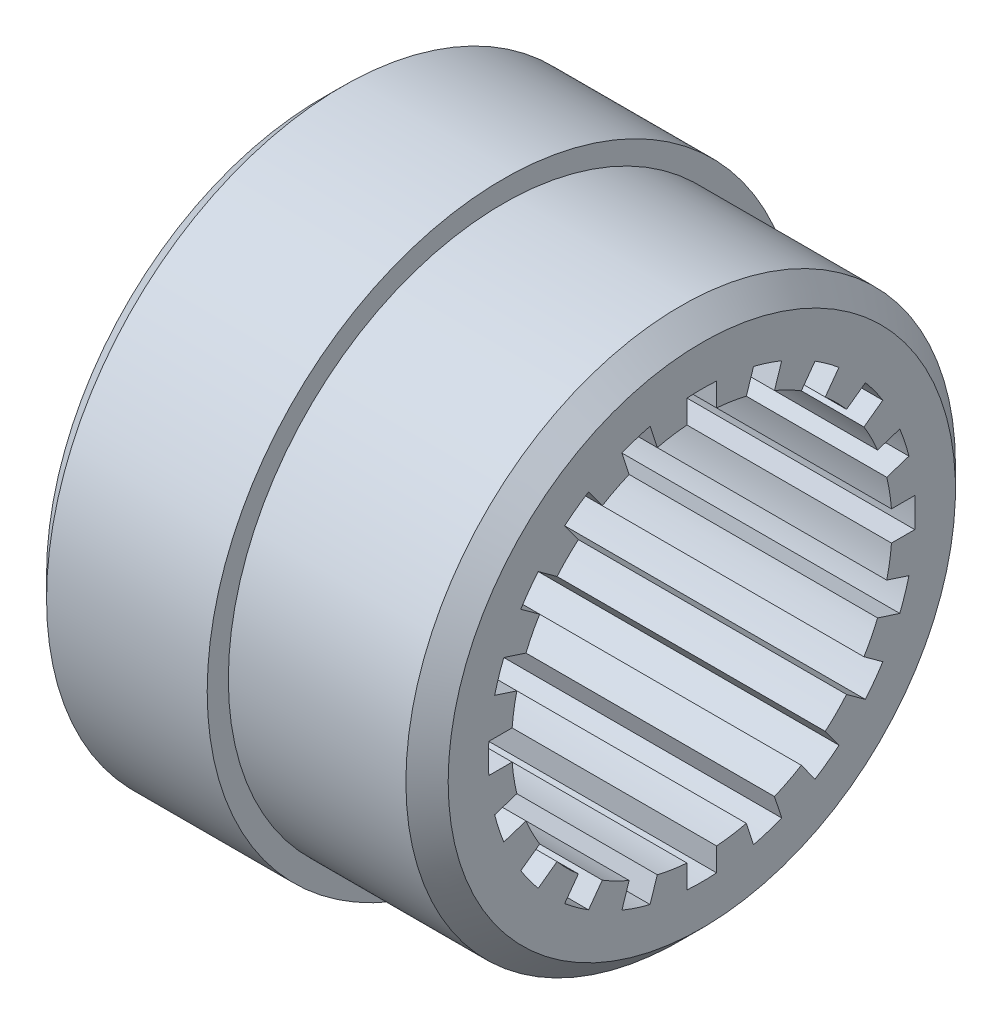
ISO-10303-21;
HEADER;
FILE_DESCRIPTION(('STEP AP214'),'2;1');
FILE_NAME('part.step','',(''),(''),'','','');
FILE_SCHEMA(('AUTOMOTIVE_DESIGN { 1 0 10303 214 1 1 1 1 }'));
ENDSEC;
DATA;
#1=APPLICATION_CONTEXT('core data for automotive mechanical design processes');
#2=APPLICATION_PROTOCOL_DEFINITION('international standard','automotive_design',2000,#1);
#3=PRODUCT_CONTEXT('',#1,'mechanical');
#4=PRODUCT('Part','Part','',(#3));
#5=PRODUCT_RELATED_PRODUCT_CATEGORY('part','',(#4));
#6=PRODUCT_DEFINITION_FORMATION('','',#4);
#7=PRODUCT_DEFINITION_CONTEXT('part definition',#1,'design');
#8=PRODUCT_DEFINITION('design','',#6,#7);
#9=PRODUCT_DEFINITION_SHAPE('','',#8);
#10=(LENGTH_UNIT() NAMED_UNIT(*) SI_UNIT(.MILLI.,.METRE.));
#11=(NAMED_UNIT(*) PLANE_ANGLE_UNIT() SI_UNIT($,.RADIAN.));
#12=(NAMED_UNIT(*) SI_UNIT($,.STERADIAN.) SOLID_ANGLE_UNIT());
#13=UNCERTAINTY_MEASURE_WITH_UNIT(LENGTH_MEASURE(1.E-05),#10,'distance_accuracy_value','');
#14=(GEOMETRIC_REPRESENTATION_CONTEXT(3) GLOBAL_UNCERTAINTY_ASSIGNED_CONTEXT((#13)) GLOBAL_UNIT_ASSIGNED_CONTEXT((#10,
#11,#12)) REPRESENTATION_CONTEXT('',''));
#15=CARTESIAN_POINT('',(0.,0.,0.));
#16=DIRECTION('',(0.,0.,1.));
#17=DIRECTION('',(1.,0.,0.));
#18=AXIS2_PLACEMENT_3D('',#15,#16,#17);
#19=CARTESIAN_POINT('',(0.,0.,0.));
#20=DIRECTION('',(-1.,0.,0.));
#21=DIRECTION('',(0.,0.,1.));
#22=AXIS2_PLACEMENT_3D('',#19,#20,#21);
#23=CYLINDRICAL_SURFACE('',#22,45.);
#24=CARTESIAN_POINT('',(90.,0.,0.));
#25=DIRECTION('',(-1.,0.,0.));
#26=DIRECTION('',(0.,0.,1.));
#27=AXIS2_PLACEMENT_3D('',#24,#25,#26);
#28=CIRCLE('',#27,45.);
#29=CARTESIAN_POINT('',(90.,41.5863380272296,-17.19233810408));
#30=VERTEX_POINT('',#29);
#31=CARTESIAN_POINT('',(90.,38.3527298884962,-23.5386514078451));
#32=VERTEX_POINT('',#31);
#33=EDGE_CURVE('E1040',#30,#32,#28,.T.);
#34=ORIENTED_EDGE('',*,*,#33,.F.);
#35=DIRECTION('',(-1.,0.,0.));
#36=VECTOR('',#35,1.);
#37=CARTESIAN_POINT('',(0.,41.5863380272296,-17.19233810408));
#38=LINE('',#37,#36);
#39=CARTESIAN_POINT('',(0.,41.5863380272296,-17.19233810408));
#40=VERTEX_POINT('',#39);
#41=EDGE_CURVE('E557',#30,#40,#38,.T.);
#42=ORIENTED_EDGE('',*,*,#41,.T.);
#43=CARTESIAN_POINT('',(0.,0.,0.));
#44=DIRECTION('',(-1.,0.,0.));
#45=DIRECTION('',(0.,0.,1.));
#46=AXIS2_PLACEMENT_3D('',#43,#44,#45);
#47=CIRCLE('',#46,45.);
#48=CARTESIAN_POINT('',(0.,38.3527298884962,-23.5386514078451));
#49=VERTEX_POINT('',#48);
#50=EDGE_CURVE('E53',#40,#49,#47,.T.);
#51=ORIENTED_EDGE('',*,*,#50,.T.);
#52=DIRECTION('',(-1.,0.,0.));
#53=VECTOR('',#52,1.);
#54=CARTESIAN_POINT('',(0.,38.3527298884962,-23.5386514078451));
#55=LINE('',#54,#53);
#56=EDGE_CURVE('E576',#49,#32,#55,.F.);
#57=ORIENTED_EDGE('',*,*,#56,.T.);
#58=EDGE_LOOP('',(#34,#42,#51,#57));
#59=FACE_BOUND('',#58,.T.);
#60=ADVANCED_FACE('F31',(#59),#23,.F.);
#61=CARTESIAN_POINT('',(90.,34.2382331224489,-29.2017703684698));
#62=VERTEX_POINT('',#61);
#63=CARTESIAN_POINT('',(90.,29.2017703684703,-34.2382331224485));
#64=VERTEX_POINT('',#63);
#65=EDGE_CURVE('E1125',#62,#64,#28,.T.);
#66=ORIENTED_EDGE('',*,*,#65,.F.);
#67=DIRECTION('',(-1.,0.,0.));
#68=VECTOR('',#67,1.);
#69=CARTESIAN_POINT('',(0.,34.2382331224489,-29.2017703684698));
#70=LINE('',#69,#68);
#71=CARTESIAN_POINT('',(0.,34.2382331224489,-29.2017703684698));
#72=VERTEX_POINT('',#71);
#73=EDGE_CURVE('E580',#62,#72,#70,.T.);
#74=ORIENTED_EDGE('',*,*,#73,.T.);
#75=CARTESIAN_POINT('',(0.,29.2017703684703,-34.2382331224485));
#76=VERTEX_POINT('',#75);
#77=EDGE_CURVE('E1249',#72,#76,#47,.T.);
#78=ORIENTED_EDGE('',*,*,#77,.T.);
#79=DIRECTION('',(-1.,0.,0.));
#80=VECTOR('',#79,1.);
#81=CARTESIAN_POINT('',(0.,29.2017703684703,-34.2382331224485));
#82=LINE('',#81,#80);
#83=EDGE_CURVE('E600',#76,#64,#82,.F.);
#84=ORIENTED_EDGE('',*,*,#83,.T.);
#85=EDGE_LOOP('',(#66,#74,#78,#84));
#86=FACE_BOUND('',#85,.T.);
#87=ADVANCED_FACE('F1256',(#86),#23,.F.);
#88=CARTESIAN_POINT('',(90.,23.5386514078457,-38.3527298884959));
#89=VERTEX_POINT('',#88);
#90=CARTESIAN_POINT('',(90.,17.1923381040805,-41.5863380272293));
#91=VERTEX_POINT('',#90);
#92=EDGE_CURVE('E1126',#89,#91,#28,.T.);
#93=ORIENTED_EDGE('',*,*,#92,.F.);
#94=DIRECTION('',(-1.,0.,0.));
#95=VECTOR('',#94,1.);
#96=CARTESIAN_POINT('',(0.,23.5386514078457,-38.3527298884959));
#97=LINE('',#96,#95);
#98=CARTESIAN_POINT('',(0.,23.5386514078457,-38.3527298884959));
#99=VERTEX_POINT('',#98);
#100=EDGE_CURVE('E605',#89,#99,#97,.T.);
#101=ORIENTED_EDGE('',*,*,#100,.T.);
#102=CARTESIAN_POINT('',(0.,17.1923381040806,-41.5863380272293));
#103=VERTEX_POINT('',#102);
#104=EDGE_CURVE('E1245',#99,#103,#47,.T.);
#105=ORIENTED_EDGE('',*,*,#104,.T.);
#106=DIRECTION('',(-1.,0.,0.));
#107=VECTOR('',#106,1.);
#108=CARTESIAN_POINT('',(0.,17.1923381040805,-41.5863380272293));
#109=LINE('',#108,#107);
#110=EDGE_CURVE('E625',#103,#91,#109,.F.);
#111=ORIENTED_EDGE('',*,*,#110,.T.);
#112=EDGE_LOOP('',(#93,#101,#105,#111));
#113=FACE_BOUND('',#112,.T.);
#114=ADVANCED_FACE('F1266',(#113),#23,.F.);
#115=CARTESIAN_POINT('',(90.,10.5349424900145,-43.749456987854));
#116=VERTEX_POINT('',#115);
#117=CARTESIAN_POINT('',(90.,3.50000000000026,-44.8636824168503));
#118=VERTEX_POINT('',#117);
#119=EDGE_CURVE('E1129',#116,#118,#28,.T.);
#120=ORIENTED_EDGE('',*,*,#119,.F.);
#121=DIRECTION('',(-1.,0.,0.));
#122=VECTOR('',#121,1.);
#123=CARTESIAN_POINT('',(0.,10.5349424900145,-43.749456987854));
#124=LINE('',#123,#122);
#125=CARTESIAN_POINT('',(0.,10.5349424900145,-43.749456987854));
#126=VERTEX_POINT('',#125);
#127=EDGE_CURVE('E630',#116,#126,#124,.T.);
#128=ORIENTED_EDGE('',*,*,#127,.T.);
#129=CARTESIAN_POINT('',(0.,3.50000000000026,-44.8636824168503));
#130=VERTEX_POINT('',#129);
#131=EDGE_CURVE('E1241',#126,#130,#47,.T.);
#132=ORIENTED_EDGE('',*,*,#131,.T.);
#133=DIRECTION('',(-1.,0.,0.));
#134=VECTOR('',#133,1.);
#135=CARTESIAN_POINT('',(0.,3.50000000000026,-44.8636824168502));
#136=LINE('',#135,#134);
#137=EDGE_CURVE('E650',#130,#118,#136,.F.);
#138=ORIENTED_EDGE('',*,*,#137,.T.);
#139=EDGE_LOOP('',(#120,#128,#132,#138));
#140=FACE_BOUND('',#139,.T.);
#141=ADVANCED_FACE('F1276',(#140),#23,.F.);
#142=CARTESIAN_POINT('',(90.,-3.49999999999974,-44.8636824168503));
#143=VERTEX_POINT('',#142);
#144=CARTESIAN_POINT('',(90.,-10.534942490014,-43.7494569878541));
#145=VERTEX_POINT('',#144);
#146=EDGE_CURVE('E1132',#143,#145,#28,.T.);
#147=ORIENTED_EDGE('',*,*,#146,.F.);
#148=DIRECTION('',(-1.,0.,0.));
#149=VECTOR('',#148,1.);
#150=CARTESIAN_POINT('',(0.,-3.49999999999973,-44.8636824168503));
#151=LINE('',#150,#149);
#152=CARTESIAN_POINT('',(0.,-3.49999999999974,-44.8636824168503));
#153=VERTEX_POINT('',#152);
#154=EDGE_CURVE('E655',#143,#153,#151,.T.);
#155=ORIENTED_EDGE('',*,*,#154,.T.);
#156=CARTESIAN_POINT('',(0.,-10.534942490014,-43.7494569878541));
#157=VERTEX_POINT('',#156);
#158=EDGE_CURVE('E1237',#153,#157,#47,.T.);
#159=ORIENTED_EDGE('',*,*,#158,.T.);
#160=DIRECTION('',(-1.,0.,0.));
#161=VECTOR('',#160,1.);
#162=CARTESIAN_POINT('',(0.,-10.534942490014,-43.7494569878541));
#163=LINE('',#162,#161);
#164=EDGE_CURVE('E675',#157,#145,#163,.F.);
#165=ORIENTED_EDGE('',*,*,#164,.T.);
#166=EDGE_LOOP('',(#147,#155,#159,#165));
#167=FACE_BOUND('',#166,.T.);
#168=ADVANCED_FACE('F1286',(#167),#23,.F.);
#169=CARTESIAN_POINT('',(90.,-17.1923381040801,-41.5863380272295));
#170=VERTEX_POINT('',#169);
#171=CARTESIAN_POINT('',(90.,-23.5386514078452,-38.3527298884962));
#172=VERTEX_POINT('',#171);
#173=EDGE_CURVE('E1135',#170,#172,#28,.T.);
#174=ORIENTED_EDGE('',*,*,#173,.F.);
#175=DIRECTION('',(-1.,0.,0.));
#176=VECTOR('',#175,1.);
#177=CARTESIAN_POINT('',(0.,-17.1923381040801,-41.5863380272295));
#178=LINE('',#177,#176);
#179=CARTESIAN_POINT('',(0.,-17.1923381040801,-41.5863380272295));
#180=VERTEX_POINT('',#179);
#181=EDGE_CURVE('E680',#170,#180,#178,.T.);
#182=ORIENTED_EDGE('',*,*,#181,.T.);
#183=CARTESIAN_POINT('',(0.,-23.5386514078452,-38.3527298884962));
#184=VERTEX_POINT('',#183);
#185=EDGE_CURVE('E1233',#180,#184,#47,.T.);
#186=ORIENTED_EDGE('',*,*,#185,.T.);
#187=DIRECTION('',(-1.,0.,0.));
#188=VECTOR('',#187,1.);
#189=CARTESIAN_POINT('',(0.,-23.5386514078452,-38.3527298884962));
#190=LINE('',#189,#188);
#191=EDGE_CURVE('E700',#184,#172,#190,.F.);
#192=ORIENTED_EDGE('',*,*,#191,.T.);
#193=EDGE_LOOP('',(#174,#182,#186,#192));
#194=FACE_BOUND('',#193,.T.);
#195=ADVANCED_FACE('F1296',(#194),#23,.F.);
#196=CARTESIAN_POINT('',(90.,-29.2017703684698,-34.2382331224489));
#197=VERTEX_POINT('',#196);
#198=CARTESIAN_POINT('',(90.,-34.2382331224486,-29.2017703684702));
#199=VERTEX_POINT('',#198);
#200=EDGE_CURVE('E1138',#197,#199,#28,.T.);
#201=ORIENTED_EDGE('',*,*,#200,.F.);
#202=DIRECTION('',(-1.,0.,0.));
#203=VECTOR('',#202,1.);
#204=CARTESIAN_POINT('',(0.,-29.2017703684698,-34.2382331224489));
#205=LINE('',#204,#203);
#206=CARTESIAN_POINT('',(0.,-29.2017703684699,-34.2382331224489));
#207=VERTEX_POINT('',#206);
#208=EDGE_CURVE('E705',#197,#207,#205,.T.);
#209=ORIENTED_EDGE('',*,*,#208,.T.);
#210=CARTESIAN_POINT('',(0.,-34.2382331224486,-29.2017703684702));
#211=VERTEX_POINT('',#210);
#212=EDGE_CURVE('E1229',#207,#211,#47,.T.);
#213=ORIENTED_EDGE('',*,*,#212,.T.);
#214=DIRECTION('',(-1.,0.,0.));
#215=VECTOR('',#214,1.);
#216=CARTESIAN_POINT('',(0.,-34.2382331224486,-29.2017703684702));
#217=LINE('',#216,#215);
#218=EDGE_CURVE('E725',#211,#199,#217,.F.);
#219=ORIENTED_EDGE('',*,*,#218,.T.);
#220=EDGE_LOOP('',(#201,#209,#213,#219));
#221=FACE_BOUND('',#220,.T.);
#222=ADVANCED_FACE('F1306',(#221),#23,.F.);
#223=CARTESIAN_POINT('',(90.,-38.3527298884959,-23.5386514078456));
#224=VERTEX_POINT('',#223);
#225=CARTESIAN_POINT('',(90.,-41.5863380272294,-17.1923381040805));
#226=VERTEX_POINT('',#225);
#227=EDGE_CURVE('E1141',#224,#226,#28,.T.);
#228=ORIENTED_EDGE('',*,*,#227,.F.);
#229=DIRECTION('',(-1.,0.,0.));
#230=VECTOR('',#229,1.);
#231=CARTESIAN_POINT('',(0.,-38.3527298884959,-23.5386514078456));
#232=LINE('',#231,#230);
#233=CARTESIAN_POINT('',(0.,-38.3527298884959,-23.5386514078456));
#234=VERTEX_POINT('',#233);
#235=EDGE_CURVE('E730',#224,#234,#232,.T.);
#236=ORIENTED_EDGE('',*,*,#235,.T.);
#237=CARTESIAN_POINT('',(0.,-41.5863380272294,-17.1923381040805));
#238=VERTEX_POINT('',#237);
#239=EDGE_CURVE('E1225',#234,#238,#47,.T.);
#240=ORIENTED_EDGE('',*,*,#239,.T.);
#241=DIRECTION('',(-1.,0.,0.));
#242=VECTOR('',#241,1.);
#243=CARTESIAN_POINT('',(0.,-41.5863380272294,-17.1923381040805));
#244=LINE('',#243,#242);
#245=EDGE_CURVE('E750',#238,#226,#244,.F.);
#246=ORIENTED_EDGE('',*,*,#245,.T.);
#247=EDGE_LOOP('',(#228,#236,#240,#246));
#248=FACE_BOUND('',#247,.T.);
#249=ADVANCED_FACE('F1316',(#248),#23,.F.);
#250=CARTESIAN_POINT('',(90.,-43.749456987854,-10.5349424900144));
#251=VERTEX_POINT('',#250);
#252=CARTESIAN_POINT('',(90.,-44.8636824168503,-3.50000000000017));
#253=VERTEX_POINT('',#252);
#254=EDGE_CURVE('E1144',#251,#253,#28,.T.);
#255=ORIENTED_EDGE('',*,*,#254,.F.);
#256=DIRECTION('',(-1.,0.,0.));
#257=VECTOR('',#256,1.);
#258=CARTESIAN_POINT('',(0.,-43.749456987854,-10.5349424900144));
#259=LINE('',#258,#257);
#260=CARTESIAN_POINT('',(0.,-43.749456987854,-10.5349424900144));
#261=VERTEX_POINT('',#260);
#262=EDGE_CURVE('E755',#251,#261,#259,.T.);
#263=ORIENTED_EDGE('',*,*,#262,.T.);
#264=CARTESIAN_POINT('',(0.,-44.8636824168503,-3.50000000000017));
#265=VERTEX_POINT('',#264);
#266=EDGE_CURVE('E1221',#261,#265,#47,.T.);
#267=ORIENTED_EDGE('',*,*,#266,.T.);
#268=DIRECTION('',(-1.,0.,0.));
#269=VECTOR('',#268,1.);
#270=CARTESIAN_POINT('',(0.,-44.8636824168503,-3.50000000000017));
#271=LINE('',#270,#269);
#272=EDGE_CURVE('E775',#265,#253,#271,.F.);
#273=ORIENTED_EDGE('',*,*,#272,.T.);
#274=EDGE_LOOP('',(#255,#263,#267,#273));
#275=FACE_BOUND('',#274,.T.);
#276=ADVANCED_FACE('F1326',(#275),#23,.F.);
#277=CARTESIAN_POINT('',(90.,-44.8636824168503,3.49999999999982));
#278=VERTEX_POINT('',#277);
#279=CARTESIAN_POINT('',(90.,-43.7494569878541,10.534942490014));
#280=VERTEX_POINT('',#279);
#281=EDGE_CURVE('E1147',#278,#280,#28,.T.);
#282=ORIENTED_EDGE('',*,*,#281,.F.);
#283=DIRECTION('',(-1.,0.,0.));
#284=VECTOR('',#283,1.);
#285=CARTESIAN_POINT('',(0.,-44.8636824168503,3.49999999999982));
#286=LINE('',#285,#284);
#287=CARTESIAN_POINT('',(0.,-44.8636824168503,3.49999999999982));
#288=VERTEX_POINT('',#287);
#289=EDGE_CURVE('E780',#278,#288,#286,.T.);
#290=ORIENTED_EDGE('',*,*,#289,.T.);
#291=CARTESIAN_POINT('',(0.,-43.7494569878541,10.534942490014));
#292=VERTEX_POINT('',#291);
#293=EDGE_CURVE('E1217',#288,#292,#47,.T.);
#294=ORIENTED_EDGE('',*,*,#293,.T.);
#295=DIRECTION('',(-1.,0.,0.));
#296=VECTOR('',#295,1.);
#297=CARTESIAN_POINT('',(0.,-43.7494569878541,10.534942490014));
#298=LINE('',#297,#296);
#299=EDGE_CURVE('E800',#292,#280,#298,.F.);
#300=ORIENTED_EDGE('',*,*,#299,.T.);
#301=EDGE_LOOP('',(#282,#290,#294,#300));
#302=FACE_BOUND('',#301,.T.);
#303=ADVANCED_FACE('F1336',(#302),#23,.F.);
#304=CARTESIAN_POINT('',(90.,-41.5863380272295,17.1923381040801));
#305=VERTEX_POINT('',#304);
#306=CARTESIAN_POINT('',(90.,-38.3527298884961,23.5386514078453));
#307=VERTEX_POINT('',#306);
#308=EDGE_CURVE('E1150',#305,#307,#28,.T.);
#309=ORIENTED_EDGE('',*,*,#308,.F.);
#310=DIRECTION('',(-1.,0.,0.));
#311=VECTOR('',#310,1.);
#312=CARTESIAN_POINT('',(0.,-41.5863380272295,17.1923381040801));
#313=LINE('',#312,#311);
#314=CARTESIAN_POINT('',(0.,-41.5863380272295,17.1923381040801));
#315=VERTEX_POINT('',#314);
#316=EDGE_CURVE('E805',#305,#315,#313,.T.);
#317=ORIENTED_EDGE('',*,*,#316,.T.);
#318=CARTESIAN_POINT('',(0.,-38.3527298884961,23.5386514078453));
#319=VERTEX_POINT('',#318);
#320=EDGE_CURVE('E1213',#315,#319,#47,.T.);
#321=ORIENTED_EDGE('',*,*,#320,.T.);
#322=DIRECTION('',(-1.,0.,0.));
#323=VECTOR('',#322,1.);
#324=CARTESIAN_POINT('',(0.,-38.3527298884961,23.5386514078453));
#325=LINE('',#324,#323);
#326=EDGE_CURVE('E825',#319,#307,#325,.F.);
#327=ORIENTED_EDGE('',*,*,#326,.T.);
#328=EDGE_LOOP('',(#309,#317,#321,#327));
#329=FACE_BOUND('',#328,.T.);
#330=ADVANCED_FACE('F1346',(#329),#23,.F.);
#331=CARTESIAN_POINT('',(90.,-34.2382331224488,29.2017703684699));
#332=VERTEX_POINT('',#331);
#333=CARTESIAN_POINT('',(90.,-29.2017703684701,34.2382331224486));
#334=VERTEX_POINT('',#333);
#335=EDGE_CURVE('E1153',#332,#334,#28,.T.);
#336=ORIENTED_EDGE('',*,*,#335,.F.);
#337=DIRECTION('',(-1.,0.,0.));
#338=VECTOR('',#337,1.);
#339=CARTESIAN_POINT('',(0.,-34.2382331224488,29.2017703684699));
#340=LINE('',#339,#338);
#341=CARTESIAN_POINT('',(0.,-34.2382331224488,29.2017703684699));
#342=VERTEX_POINT('',#341);
#343=EDGE_CURVE('E830',#332,#342,#340,.T.);
#344=ORIENTED_EDGE('',*,*,#343,.T.);
#345=CARTESIAN_POINT('',(0.,-29.2017703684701,34.2382331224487));
#346=VERTEX_POINT('',#345);
#347=EDGE_CURVE('E1209',#342,#346,#47,.T.);
#348=ORIENTED_EDGE('',*,*,#347,.T.);
#349=DIRECTION('',(-1.,0.,0.));
#350=VECTOR('',#349,1.);
#351=CARTESIAN_POINT('',(0.,-29.2017703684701,34.2382331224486));
#352=LINE('',#351,#350);
#353=EDGE_CURVE('E850',#346,#334,#352,.F.);
#354=ORIENTED_EDGE('',*,*,#353,.T.);
#355=EDGE_LOOP('',(#336,#344,#348,#354));
#356=FACE_BOUND('',#355,.T.);
#357=ADVANCED_FACE('F1356',(#356),#23,.F.);
#358=CARTESIAN_POINT('',(90.,-23.5386514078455,38.352729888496));
#359=VERTEX_POINT('',#358);
#360=CARTESIAN_POINT('',(90.,-17.1923381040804,41.5863380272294));
#361=VERTEX_POINT('',#360);
#362=EDGE_CURVE('E1156',#359,#361,#28,.T.);
#363=ORIENTED_EDGE('',*,*,#362,.F.);
#364=DIRECTION('',(-1.,0.,0.));
#365=VECTOR('',#364,1.);
#366=CARTESIAN_POINT('',(0.,-23.5386514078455,38.352729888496));
#367=LINE('',#366,#365);
#368=CARTESIAN_POINT('',(0.,-23.5386514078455,38.352729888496));
#369=VERTEX_POINT('',#368);
#370=EDGE_CURVE('E855',#359,#369,#367,.T.);
#371=ORIENTED_EDGE('',*,*,#370,.T.);
#372=CARTESIAN_POINT('',(0.,-17.1923381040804,41.5863380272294));
#373=VERTEX_POINT('',#372);
#374=EDGE_CURVE('E1205',#369,#373,#47,.T.);
#375=ORIENTED_EDGE('',*,*,#374,.T.);
#376=DIRECTION('',(-1.,0.,0.));
#377=VECTOR('',#376,1.);
#378=CARTESIAN_POINT('',(0.,-17.1923381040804,41.5863380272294));
#379=LINE('',#378,#377);
#380=EDGE_CURVE('E875',#373,#361,#379,.F.);
#381=ORIENTED_EDGE('',*,*,#380,.T.);
#382=EDGE_LOOP('',(#363,#371,#375,#381));
#383=FACE_BOUND('',#382,.T.);
#384=ADVANCED_FACE('F1366',(#383),#23,.F.);
#385=CARTESIAN_POINT('',(90.,-10.5349424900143,43.749456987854));
#386=VERTEX_POINT('',#385);
#387=CARTESIAN_POINT('',(90.,-3.50000000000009,44.8636824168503));
#388=VERTEX_POINT('',#387);
#389=EDGE_CURVE('E1159',#386,#388,#28,.T.);
#390=ORIENTED_EDGE('',*,*,#389,.F.);
#391=DIRECTION('',(-1.,0.,0.));
#392=VECTOR('',#391,1.);
#393=CARTESIAN_POINT('',(0.,-10.5349424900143,43.749456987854));
#394=LINE('',#393,#392);
#395=CARTESIAN_POINT('',(0.,-10.5349424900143,43.749456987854));
#396=VERTEX_POINT('',#395);
#397=EDGE_CURVE('E880',#386,#396,#394,.T.);
#398=ORIENTED_EDGE('',*,*,#397,.T.);
#399=CARTESIAN_POINT('',(0.,-3.50000000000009,44.8636824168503));
#400=VERTEX_POINT('',#399);
#401=EDGE_CURVE('E1201',#396,#400,#47,.T.);
#402=ORIENTED_EDGE('',*,*,#401,.T.);
#403=DIRECTION('',(-1.,0.,0.));
#404=VECTOR('',#403,1.);
#405=CARTESIAN_POINT('',(0.,-3.50000000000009,44.8636824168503));
#406=LINE('',#405,#404);
#407=EDGE_CURVE('E900',#400,#388,#406,.F.);
#408=ORIENTED_EDGE('',*,*,#407,.T.);
#409=EDGE_LOOP('',(#390,#398,#402,#408));
#410=FACE_BOUND('',#409,.T.);
#411=ADVANCED_FACE('F1376',(#410),#23,.F.);
#412=CARTESIAN_POINT('',(90.,3.4999999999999,44.8636824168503));
#413=VERTEX_POINT('',#412);
#414=CARTESIAN_POINT('',(90.,10.5349424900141,43.7494569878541));
#415=VERTEX_POINT('',#414);
#416=EDGE_CURVE('E1162',#413,#415,#28,.T.);
#417=ORIENTED_EDGE('',*,*,#416,.F.);
#418=DIRECTION('',(-1.,0.,0.));
#419=VECTOR('',#418,1.);
#420=CARTESIAN_POINT('',(0.,3.4999999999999,44.8636824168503));
#421=LINE('',#420,#419);
#422=CARTESIAN_POINT('',(0.,3.4999999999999,44.8636824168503));
#423=VERTEX_POINT('',#422);
#424=EDGE_CURVE('E905',#413,#423,#421,.T.);
#425=ORIENTED_EDGE('',*,*,#424,.T.);
#426=CARTESIAN_POINT('',(0.,10.5349424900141,43.7494569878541));
#427=VERTEX_POINT('',#426);
#428=EDGE_CURVE('E1197',#423,#427,#47,.T.);
#429=ORIENTED_EDGE('',*,*,#428,.T.);
#430=DIRECTION('',(-1.,0.,0.));
#431=VECTOR('',#430,1.);
#432=CARTESIAN_POINT('',(0.,10.5349424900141,43.7494569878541));
#433=LINE('',#432,#431);
#434=EDGE_CURVE('E925',#427,#415,#433,.F.);
#435=ORIENTED_EDGE('',*,*,#434,.T.);
#436=EDGE_LOOP('',(#417,#425,#429,#435));
#437=FACE_BOUND('',#436,.T.);
#438=ADVANCED_FACE('F1386',(#437),#23,.F.);
#439=CARTESIAN_POINT('',(90.,17.1923381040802,41.5863380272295));
#440=VERTEX_POINT('',#439);
#441=CARTESIAN_POINT('',(90.,23.5386514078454,38.3527298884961));
#442=VERTEX_POINT('',#441);
#443=EDGE_CURVE('E1165',#440,#442,#28,.T.);
#444=ORIENTED_EDGE('',*,*,#443,.F.);
#445=DIRECTION('',(-1.,0.,0.));
#446=VECTOR('',#445,1.);
#447=CARTESIAN_POINT('',(0.,17.1923381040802,41.5863380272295));
#448=LINE('',#447,#446);
#449=CARTESIAN_POINT('',(0.,17.1923381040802,41.5863380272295));
#450=VERTEX_POINT('',#449);
#451=EDGE_CURVE('E930',#440,#450,#448,.T.);
#452=ORIENTED_EDGE('',*,*,#451,.T.);
#453=CARTESIAN_POINT('',(0.,23.5386514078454,38.3527298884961));
#454=VERTEX_POINT('',#453);
#455=EDGE_CURVE('E1193',#450,#454,#47,.T.);
#456=ORIENTED_EDGE('',*,*,#455,.T.);
#457=DIRECTION('',(-1.,0.,0.));
#458=VECTOR('',#457,1.);
#459=CARTESIAN_POINT('',(0.,23.5386514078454,38.3527298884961));
#460=LINE('',#459,#458);
#461=EDGE_CURVE('E950',#454,#442,#460,.F.);
#462=ORIENTED_EDGE('',*,*,#461,.T.);
#463=EDGE_LOOP('',(#444,#452,#456,#462));
#464=FACE_BOUND('',#463,.T.);
#465=ADVANCED_FACE('F1396',(#464),#23,.F.);
#466=CARTESIAN_POINT('',(90.,29.20177036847,34.2382331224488));
#467=VERTEX_POINT('',#466);
#468=CARTESIAN_POINT('',(90.,34.2382331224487,29.2017703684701));
#469=VERTEX_POINT('',#468);
#470=EDGE_CURVE('E1168',#467,#469,#28,.T.);
#471=ORIENTED_EDGE('',*,*,#470,.F.);
#472=DIRECTION('',(-1.,0.,0.));
#473=VECTOR('',#472,1.);
#474=CARTESIAN_POINT('',(0.,29.20177036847,34.2382331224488));
#475=LINE('',#474,#473);
#476=CARTESIAN_POINT('',(0.,29.20177036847,34.2382331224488));
#477=VERTEX_POINT('',#476);
#478=EDGE_CURVE('E955',#467,#477,#475,.T.);
#479=ORIENTED_EDGE('',*,*,#478,.T.);
#480=CARTESIAN_POINT('',(0.,34.2382331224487,29.2017703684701));
#481=VERTEX_POINT('',#480);
#482=EDGE_CURVE('E1189',#477,#481,#47,.T.);
#483=ORIENTED_EDGE('',*,*,#482,.T.);
#484=DIRECTION('',(-1.,0.,0.));
#485=VECTOR('',#484,1.);
#486=CARTESIAN_POINT('',(0.,34.2382331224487,29.2017703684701));
#487=LINE('',#486,#485);
#488=EDGE_CURVE('E975',#481,#469,#487,.F.);
#489=ORIENTED_EDGE('',*,*,#488,.T.);
#490=EDGE_LOOP('',(#471,#479,#483,#489));
#491=FACE_BOUND('',#490,.T.);
#492=ADVANCED_FACE('F1406',(#491),#23,.F.);
#493=CARTESIAN_POINT('',(90.,38.352729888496,23.5386514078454));
#494=VERTEX_POINT('',#493);
#495=CARTESIAN_POINT('',(90.,41.5863380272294,17.1923381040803));
#496=VERTEX_POINT('',#495);
#497=EDGE_CURVE('E1171',#494,#496,#28,.T.);
#498=ORIENTED_EDGE('',*,*,#497,.F.);
#499=DIRECTION('',(-1.,0.,0.));
#500=VECTOR('',#499,1.);
#501=CARTESIAN_POINT('',(0.,38.352729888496,23.5386514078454));
#502=LINE('',#501,#500);
#503=CARTESIAN_POINT('',(0.,38.352729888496,23.5386514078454));
#504=VERTEX_POINT('',#503);
#505=EDGE_CURVE('E980',#494,#504,#502,.T.);
#506=ORIENTED_EDGE('',*,*,#505,.T.);
#507=CARTESIAN_POINT('',(0.,41.5863380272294,17.1923381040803));
#508=VERTEX_POINT('',#507);
#509=EDGE_CURVE('E1188',#504,#508,#47,.T.);
#510=ORIENTED_EDGE('',*,*,#509,.T.);
#511=DIRECTION('',(-1.,0.,0.));
#512=VECTOR('',#511,1.);
#513=CARTESIAN_POINT('',(0.,41.5863380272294,17.1923381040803));
#514=LINE('',#513,#512);
#515=EDGE_CURVE('E1000',#508,#496,#514,.F.);
#516=ORIENTED_EDGE('',*,*,#515,.T.);
#517=EDGE_LOOP('',(#498,#506,#510,#516));
#518=FACE_BOUND('',#517,.T.);
#519=ADVANCED_FACE('F1416',(#518),#23,.F.);
#520=CARTESIAN_POINT('',(90.,43.7494569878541,10.5349424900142));
#521=VERTEX_POINT('',#520);
#522=CARTESIAN_POINT('',(90.,44.8636824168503,3.5));
#523=VERTEX_POINT('',#522);
#524=EDGE_CURVE('E1035',#521,#523,#28,.T.);
#525=ORIENTED_EDGE('',*,*,#524,.F.);
#526=DIRECTION('',(-1.,0.,0.));
#527=VECTOR('',#526,1.);
#528=CARTESIAN_POINT('',(0.,43.7494569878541,10.5349424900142));
#529=LINE('',#528,#527);
#530=CARTESIAN_POINT('',(0.,43.7494569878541,10.5349424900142));
#531=VERTEX_POINT('',#530);
#532=EDGE_CURVE('E1005',#521,#531,#529,.T.);
#533=ORIENTED_EDGE('',*,*,#532,.T.);
#534=CARTESIAN_POINT('',(0.,44.8636824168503,3.5));
#535=VERTEX_POINT('',#534);
#536=EDGE_CURVE('E1032',#531,#535,#47,.T.);
#537=ORIENTED_EDGE('',*,*,#536,.T.);
#538=DIRECTION('',(-1.,0.,0.));
#539=VECTOR('',#538,1.);
#540=CARTESIAN_POINT('',(0.,44.8636824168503,3.5));
#541=LINE('',#540,#539);
#542=EDGE_CURVE('E1029',#535,#523,#541,.F.);
#543=ORIENTED_EDGE('',*,*,#542,.T.);
#544=EDGE_LOOP('',(#525,#533,#537,#543));
#545=FACE_BOUND('',#544,.T.);
#546=ADVANCED_FACE('F1185',(#545),#23,.F.);
#547=CARTESIAN_POINT('',(0.,0.,0.));
#548=DIRECTION('',(-1.,0.,0.));
#549=DIRECTION('',(0.,0.,1.));
#550=AXIS2_PLACEMENT_3D('',#547,#548,#549);
#551=CYLINDRICAL_SURFACE('',#550,70.);
#552=CARTESIAN_POINT('',(4.99999999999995,0.,0.));
#553=DIRECTION('',(1.,0.,0.));
#554=DIRECTION('',(0.,0.,-1.));
#555=AXIS2_PLACEMENT_3D('',#552,#553,#554);
#556=CIRCLE('',#555,70.);
#557=CARTESIAN_POINT('',(4.99999999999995,0.,-70.));
#558=VERTEX_POINT('',#557);
#559=EDGE_CURVE('E1055',#558,#558,#556,.T.);
#560=ORIENTED_EDGE('',*,*,#559,.T.);
#561=EDGE_LOOP('',(#560));
#562=FACE_BOUND('',#561,.T.);
#563=CARTESIAN_POINT('',(43.,0.,0.));
#564=DIRECTION('',(-1.,0.,0.));
#565=DIRECTION('',(0.,0.,1.));
#566=AXIS2_PLACEMENT_3D('',#563,#564,#565);
#567=CIRCLE('',#566,70.);
#568=CARTESIAN_POINT('',(43.,0.,70.));
#569=VERTEX_POINT('',#568);
#570=EDGE_CURVE('E1043',#569,#569,#567,.T.);
#571=ORIENTED_EDGE('',*,*,#570,.T.);
#572=EDGE_LOOP('',(#571));
#573=FACE_BOUND('',#572,.T.);
#574=ADVANCED_FACE('F33',(#562,#573),#551,.T.);
#575=CARTESIAN_POINT('',(43.,65.,0.));
#576=DIRECTION('',(-1.,0.,0.));
#577=DIRECTION('',(0.,0.,1.));
#578=AXIS2_PLACEMENT_3D('',#575,#576,#577);
#579=PLANE('',#578);
#580=ORIENTED_EDGE('',*,*,#570,.F.);
#581=EDGE_LOOP('',(#580));
#582=FACE_BOUND('',#581,.T.);
#583=CARTESIAN_POINT('',(43.,0.,0.));
#584=DIRECTION('',(-1.,0.,0.));
#585=DIRECTION('',(0.,0.,1.));
#586=AXIS2_PLACEMENT_3D('',#583,#584,#585);
#587=CIRCLE('',#586,65.);
#588=CARTESIAN_POINT('',(43.,0.,65.));
#589=VERTEX_POINT('',#588);
#590=EDGE_CURVE('E1039',#589,#589,#587,.T.);
#591=ORIENTED_EDGE('',*,*,#590,.T.);
#592=EDGE_LOOP('',(#591));
#593=FACE_BOUND('',#592,.T.);
#594=ADVANCED_FACE('F1460',(#582,#593),#579,.F.);
#595=CARTESIAN_POINT('',(0.,0.,0.));
#596=DIRECTION('',(-1.,0.,0.));
#597=DIRECTION('',(0.,0.,1.));
#598=AXIS2_PLACEMENT_3D('',#595,#596,#597);
#599=CYLINDRICAL_SURFACE('',#598,65.);
#600=CARTESIAN_POINT('',(85.,0.,0.));
#601=DIRECTION('',(-1.,0.,0.));
#602=DIRECTION('',(0.,0.,1.));
#603=AXIS2_PLACEMENT_3D('',#600,#601,#602);
#604=CIRCLE('',#603,65.);
#605=CARTESIAN_POINT('',(85.,0.,65.));
#606=VERTEX_POINT('',#605);
#607=EDGE_CURVE('E1046',#606,#606,#604,.T.);
#608=ORIENTED_EDGE('',*,*,#607,.T.);
#609=EDGE_LOOP('',(#608));
#610=FACE_BOUND('',#609,.T.);
#611=ORIENTED_EDGE('',*,*,#590,.F.);
#612=EDGE_LOOP('',(#611));
#613=FACE_BOUND('',#612,.T.);
#614=ADVANCED_FACE('F1454',(#610,#613),#599,.T.);
#615=CARTESIAN_POINT('',(90.,45.,0.));
#616=DIRECTION('',(-1.,0.,0.));
#617=DIRECTION('',(0.,0.,1.));
#618=AXIS2_PLACEMENT_3D('',#615,#616,#617);
#619=PLANE('',#618);
#620=CARTESIAN_POINT('',(90.,0.,0.));
#621=DIRECTION('',(-1.,0.,0.));
#622=DIRECTION('',(0.,0.,1.));
#623=AXIS2_PLACEMENT_3D('',#620,#621,#622);
#624=CIRCLE('',#623,50.5);
#625=CARTESIAN_POINT('',(90.,48.9944237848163,-12.2391355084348));
#626=VERTEX_POINT('',#625);
#627=CARTESIAN_POINT('',(90.,46.8313048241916,-18.8965311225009));
#628=VERTEX_POINT('',#627);
#629=EDGE_CURVE('E540',#626,#628,#624,.T.);
#630=ORIENTED_EDGE('',*,*,#629,.T.);
#631=DIRECTION('',(0.,-0.951056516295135,0.309016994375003));
#632=VECTOR('',#631,1.);
#633=CARTESIAN_POINT('',(90.,46.8313048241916,-18.8965311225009));
#634=LINE('',#633,#632);
#635=EDGE_CURVE('E543',#628,#30,#634,.T.);
#636=ORIENTED_EDGE('',*,*,#635,.T.);
#637=ORIENTED_EDGE('',*,*,#33,.T.);
#638=DIRECTION('',(0.,0.809016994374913,-0.587785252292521));
#639=VECTOR('',#638,1.);
#640=CARTESIAN_POINT('',(90.,42.8143651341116,-26.7802191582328));
#641=LINE('',#640,#639);
#642=CARTESIAN_POINT('',(90.,42.8143651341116,-26.7802191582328));
#643=VERTEX_POINT('',#642);
#644=EDGE_CURVE('E564',#32,#643,#641,.T.);
#645=ORIENTED_EDGE('',*,*,#644,.T.);
#646=CARTESIAN_POINT('',(90.,0.,0.));
#647=DIRECTION('',(-1.,0.,0.));
#648=DIRECTION('',(0.,0.,1.));
#649=AXIS2_PLACEMENT_3D('',#646,#647,#648);
#650=CIRCLE('',#649,50.5000000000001);
#651=CARTESIAN_POINT('',(90.,38.6998683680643,-32.4433381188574));
#652=VERTEX_POINT('',#651);
#653=EDGE_CURVE('E567',#643,#652,#650,.T.);
#654=ORIENTED_EDGE('',*,*,#653,.T.);
#655=DIRECTION('',(0.,-0.809016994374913,0.587785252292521));
#656=VECTOR('',#655,1.);
#657=CARTESIAN_POINT('',(90.,38.6998683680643,-32.4433381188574));
#658=LINE('',#657,#656);
#659=EDGE_CURVE('E570',#652,#62,#658,.T.);
#660=ORIENTED_EDGE('',*,*,#659,.T.);
#661=ORIENTED_EDGE('',*,*,#65,.T.);
#662=DIRECTION('',(0.,0.587785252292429,-0.809016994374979));
#663=VECTOR('',#662,1.);
#664=CARTESIAN_POINT('',(90.,32.4433381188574,-38.6998683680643));
#665=LINE('',#664,#663);
#666=CARTESIAN_POINT('',(90.,32.4433381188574,-38.6998683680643));
#667=VERTEX_POINT('',#666);
#668=EDGE_CURVE('E588',#64,#667,#665,.T.);
#669=ORIENTED_EDGE('',*,*,#668,.T.);
#670=CARTESIAN_POINT('',(90.,0.,0.));
#671=DIRECTION('',(-1.,0.,0.));
#672=DIRECTION('',(0.,0.,1.));
#673=AXIS2_PLACEMENT_3D('',#670,#671,#672);
#674=CIRCLE('',#673,50.5000000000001);
#675=CARTESIAN_POINT('',(90.,26.7802191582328,-42.8143651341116));
#676=VERTEX_POINT('',#675);
#677=EDGE_CURVE('E591',#667,#676,#674,.T.);
#678=ORIENTED_EDGE('',*,*,#677,.T.);
#679=DIRECTION('',(0.,-0.58778525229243,0.809016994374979));
#680=VECTOR('',#679,1.);
#681=CARTESIAN_POINT('',(90.,26.7802191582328,-42.8143651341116));
#682=LINE('',#681,#680);
#683=EDGE_CURVE('E594',#676,#89,#682,.T.);
#684=ORIENTED_EDGE('',*,*,#683,.T.);
#685=ORIENTED_EDGE('',*,*,#92,.T.);
#686=DIRECTION('',(0.,0.309016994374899,-0.951056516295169));
#687=VECTOR('',#686,1.);
#688=CARTESIAN_POINT('',(90.,18.8965311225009,-46.8313048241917));
#689=LINE('',#688,#687);
#690=CARTESIAN_POINT('',(90.,18.8965311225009,-46.8313048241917));
#691=VERTEX_POINT('',#690);
#692=EDGE_CURVE('E613',#91,#691,#689,.T.);
#693=ORIENTED_EDGE('',*,*,#692,.T.);
#694=CARTESIAN_POINT('',(90.,0.,0.));
#695=DIRECTION('',(-1.,0.,0.));
#696=DIRECTION('',(0.,0.,1.));
#697=AXIS2_PLACEMENT_3D('',#694,#695,#696);
#698=CIRCLE('',#697,50.5000000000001);
#699=CARTESIAN_POINT('',(90.,12.2391355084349,-48.9944237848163));
#700=VERTEX_POINT('',#699);
#701=EDGE_CURVE('E616',#691,#700,#698,.T.);
#702=ORIENTED_EDGE('',*,*,#701,.T.);
#703=DIRECTION('',(0.,-0.309016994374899,0.951056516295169));
#704=VECTOR('',#703,1.);
#705=CARTESIAN_POINT('',(90.,12.2391355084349,-48.9944237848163));
#706=LINE('',#705,#704);
#707=EDGE_CURVE('E619',#700,#116,#706,.T.);
#708=ORIENTED_EDGE('',*,*,#707,.T.);
#709=ORIENTED_EDGE('',*,*,#119,.T.);
#710=DIRECTION('',(0.,0.,-1.));
#711=VECTOR('',#710,1.);
#712=CARTESIAN_POINT('',(90.,3.5,-50.3785668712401));
#713=LINE('',#712,#711);
#714=CARTESIAN_POINT('',(90.,3.5,-50.3785668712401));
#715=VERTEX_POINT('',#714);
#716=EDGE_CURVE('E638',#118,#715,#713,.T.);
#717=ORIENTED_EDGE('',*,*,#716,.T.);
#718=CARTESIAN_POINT('',(90.,0.,0.));
#719=DIRECTION('',(-1.,0.,0.));
#720=DIRECTION('',(0.,0.,1.));
#721=AXIS2_PLACEMENT_3D('',#718,#719,#720);
#722=CIRCLE('',#721,50.5000000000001);
#723=CARTESIAN_POINT('',(90.,-3.49999999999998,-50.3785668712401));
#724=VERTEX_POINT('',#723);
#725=EDGE_CURVE('E641',#715,#724,#722,.T.);
#726=ORIENTED_EDGE('',*,*,#725,.T.);
#727=DIRECTION('',(0.,0.,1.));
#728=VECTOR('',#727,1.);
#729=CARTESIAN_POINT('',(90.,-3.49999999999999,-50.3785668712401));
#730=LINE('',#729,#728);
#731=EDGE_CURVE('E644',#724,#143,#730,.T.);
#732=ORIENTED_EDGE('',*,*,#731,.T.);
#733=ORIENTED_EDGE('',*,*,#146,.T.);
#734=DIRECTION('',(0.,-0.309016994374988,-0.95105651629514));
#735=VECTOR('',#734,1.);
#736=CARTESIAN_POINT('',(90.,-12.2391355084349,-48.9944237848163));
#737=LINE('',#736,#735);
#738=CARTESIAN_POINT('',(90.,-12.2391355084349,-48.9944237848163));
#739=VERTEX_POINT('',#738);
#740=EDGE_CURVE('E663',#145,#739,#737,.T.);
#741=ORIENTED_EDGE('',*,*,#740,.T.);
#742=CARTESIAN_POINT('',(90.,0.,0.));
#743=DIRECTION('',(-1.,0.,0.));
#744=DIRECTION('',(0.,0.,1.));
#745=AXIS2_PLACEMENT_3D('',#742,#743,#744);
#746=CIRCLE('',#745,50.5);
#747=CARTESIAN_POINT('',(90.,-18.8965311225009,-46.8313048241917));
#748=VERTEX_POINT('',#747);
#749=EDGE_CURVE('E666',#739,#748,#746,.T.);
#750=ORIENTED_EDGE('',*,*,#749,.T.);
#751=DIRECTION('',(0.,0.309016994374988,0.951056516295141));
#752=VECTOR('',#751,1.);
#753=CARTESIAN_POINT('',(90.,-18.8965311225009,-46.8313048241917));
#754=LINE('',#753,#752);
#755=EDGE_CURVE('E669',#748,#170,#754,.T.);
#756=ORIENTED_EDGE('',*,*,#755,.T.);
#757=ORIENTED_EDGE('',*,*,#173,.T.);
#758=DIRECTION('',(0.,-0.587785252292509,-0.809016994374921));
#759=VECTOR('',#758,1.);
#760=CARTESIAN_POINT('',(90.,-26.7802191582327,-42.8143651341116));
#761=LINE('',#760,#759);
#762=CARTESIAN_POINT('',(90.,-26.7802191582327,-42.8143651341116));
#763=VERTEX_POINT('',#762);
#764=EDGE_CURVE('E688',#172,#763,#761,.T.);
#765=ORIENTED_EDGE('',*,*,#764,.T.);
#766=CARTESIAN_POINT('',(90.,0.,0.));
#767=DIRECTION('',(-1.,0.,0.));
#768=DIRECTION('',(0.,0.,1.));
#769=AXIS2_PLACEMENT_3D('',#766,#767,#768);
#770=CIRCLE('',#769,50.5);
#771=CARTESIAN_POINT('',(90.,-32.4433381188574,-38.6998683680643));
#772=VERTEX_POINT('',#771);
#773=EDGE_CURVE('E691',#763,#772,#770,.T.);
#774=ORIENTED_EDGE('',*,*,#773,.T.);
#775=DIRECTION('',(0.,0.587785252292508,0.809016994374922));
#776=VECTOR('',#775,1.);
#777=CARTESIAN_POINT('',(90.,-32.4433381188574,-38.6998683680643));
#778=LINE('',#777,#776);
#779=EDGE_CURVE('E694',#772,#197,#778,.T.);
#780=ORIENTED_EDGE('',*,*,#779,.T.);
#781=ORIENTED_EDGE('',*,*,#200,.T.);
#782=DIRECTION('',(0.,-0.809016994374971,-0.587785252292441));
#783=VECTOR('',#782,1.);
#784=CARTESIAN_POINT('',(90.,-38.6998683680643,-32.4433381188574));
#785=LINE('',#784,#783);
#786=CARTESIAN_POINT('',(90.,-38.6998683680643,-32.4433381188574));
#787=VERTEX_POINT('',#786);
#788=EDGE_CURVE('E713',#199,#787,#785,.T.);
#789=ORIENTED_EDGE('',*,*,#788,.T.);
#790=CARTESIAN_POINT('',(90.,0.,0.));
#791=DIRECTION('',(-1.,0.,0.));
#792=DIRECTION('',(0.,0.,1.));
#793=AXIS2_PLACEMENT_3D('',#790,#791,#792);
#794=CIRCLE('',#793,50.5);
#795=CARTESIAN_POINT('',(90.,-42.8143651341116,-26.7802191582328));
#796=VERTEX_POINT('',#795);
#797=EDGE_CURVE('E716',#787,#796,#794,.T.);
#798=ORIENTED_EDGE('',*,*,#797,.T.);
#799=DIRECTION('',(0.,0.80901699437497,0.587785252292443));
#800=VECTOR('',#799,1.);
#801=CARTESIAN_POINT('',(90.,-42.8143651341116,-26.7802191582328));
#802=LINE('',#801,#800);
#803=EDGE_CURVE('E719',#796,#224,#802,.T.);
#804=ORIENTED_EDGE('',*,*,#803,.T.);
#805=ORIENTED_EDGE('',*,*,#227,.T.);
#806=DIRECTION('',(0.,-0.951056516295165,-0.309016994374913));
#807=VECTOR('',#806,1.);
#808=CARTESIAN_POINT('',(90.,-46.8313048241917,-18.8965311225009));
#809=LINE('',#808,#807);
#810=CARTESIAN_POINT('',(90.,-46.8313048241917,-18.8965311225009));
#811=VERTEX_POINT('',#810);
#812=EDGE_CURVE('E738',#226,#811,#809,.T.);
#813=ORIENTED_EDGE('',*,*,#812,.T.);
#814=CARTESIAN_POINT('',(90.,0.,0.));
#815=DIRECTION('',(-1.,0.,0.));
#816=DIRECTION('',(0.,0.,1.));
#817=AXIS2_PLACEMENT_3D('',#814,#815,#816);
#818=CIRCLE('',#817,50.5);
#819=CARTESIAN_POINT('',(90.,-48.9944237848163,-12.2391355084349));
#820=VERTEX_POINT('',#819);
#821=EDGE_CURVE('E741',#811,#820,#818,.T.);
#822=ORIENTED_EDGE('',*,*,#821,.T.);
#823=DIRECTION('',(0.,0.951056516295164,0.309016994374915));
#824=VECTOR('',#823,1.);
#825=CARTESIAN_POINT('',(90.,-48.9944237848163,-12.2391355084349));
#826=LINE('',#825,#824);
#827=EDGE_CURVE('E744',#820,#251,#826,.T.);
#828=ORIENTED_EDGE('',*,*,#827,.T.);
#829=ORIENTED_EDGE('',*,*,#254,.T.);
#830=DIRECTION('',(0.,-1.,0.));
#831=VECTOR('',#830,1.);
#832=CARTESIAN_POINT('',(90.,-50.37856687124,-3.5));
#833=LINE('',#832,#831);
#834=CARTESIAN_POINT('',(90.,-50.37856687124,-3.5));
#835=VERTEX_POINT('',#834);
#836=EDGE_CURVE('E763',#253,#835,#833,.T.);
#837=ORIENTED_EDGE('',*,*,#836,.T.);
#838=CARTESIAN_POINT('',(90.,0.,0.));
#839=DIRECTION('',(-1.,0.,0.));
#840=DIRECTION('',(0.,0.,1.));
#841=AXIS2_PLACEMENT_3D('',#838,#839,#840);
#842=CIRCLE('',#841,50.5);
#843=CARTESIAN_POINT('',(90.,-50.37856687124,3.49999999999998));
#844=VERTEX_POINT('',#843);
#845=EDGE_CURVE('E766',#835,#844,#842,.T.);
#846=ORIENTED_EDGE('',*,*,#845,.T.);
#847=DIRECTION('',(0.,1.,0.));
#848=VECTOR('',#847,1.);
#849=CARTESIAN_POINT('',(90.,-50.37856687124,3.49999999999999));
#850=LINE('',#849,#848);
#851=EDGE_CURVE('E769',#844,#278,#850,.T.);
#852=ORIENTED_EDGE('',*,*,#851,.T.);
#853=ORIENTED_EDGE('',*,*,#281,.T.);
#854=DIRECTION('',(0.,-0.951056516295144,0.309016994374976));
#855=VECTOR('',#854,1.);
#856=CARTESIAN_POINT('',(90.,-48.9944237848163,12.2391355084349));
#857=LINE('',#856,#855);
#858=CARTESIAN_POINT('',(90.,-48.9944237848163,12.2391355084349));
#859=VERTEX_POINT('',#858);
#860=EDGE_CURVE('E788',#280,#859,#857,.T.);
#861=ORIENTED_EDGE('',*,*,#860,.T.);
#862=CARTESIAN_POINT('',(90.,0.,0.));
#863=DIRECTION('',(-1.,0.,0.));
#864=DIRECTION('',(0.,0.,1.));
#865=AXIS2_PLACEMENT_3D('',#862,#863,#864);
#866=CIRCLE('',#865,50.5);
#867=CARTESIAN_POINT('',(90.,-46.8313048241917,18.8965311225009));
#868=VERTEX_POINT('',#867);
#869=EDGE_CURVE('E791',#859,#868,#866,.T.);
#870=ORIENTED_EDGE('',*,*,#869,.T.);
#871=DIRECTION('',(0.,0.951056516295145,-0.309016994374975));
#872=VECTOR('',#871,1.);
#873=CARTESIAN_POINT('',(90.,-46.8313048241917,18.8965311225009));
#874=LINE('',#873,#872);
#875=EDGE_CURVE('E794',#868,#305,#874,.T.);
#876=ORIENTED_EDGE('',*,*,#875,.T.);
#877=ORIENTED_EDGE('',*,*,#308,.T.);
#878=DIRECTION('',(0.,-0.809016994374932,0.587785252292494));
#879=VECTOR('',#878,1.);
#880=CARTESIAN_POINT('',(90.,-42.8143651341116,26.7802191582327));
#881=LINE('',#880,#879);
#882=CARTESIAN_POINT('',(90.,-42.8143651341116,26.7802191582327));
#883=VERTEX_POINT('',#882);
#884=EDGE_CURVE('E813',#307,#883,#881,.T.);
#885=ORIENTED_EDGE('',*,*,#884,.T.);
#886=CARTESIAN_POINT('',(90.,0.,0.));
#887=DIRECTION('',(-1.,0.,0.));
#888=DIRECTION('',(0.,0.,1.));
#889=AXIS2_PLACEMENT_3D('',#886,#887,#888);
#890=CIRCLE('',#889,50.5);
#891=CARTESIAN_POINT('',(90.,-38.6998683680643,32.4433381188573));
#892=VERTEX_POINT('',#891);
#893=EDGE_CURVE('E816',#883,#892,#890,.T.);
#894=ORIENTED_EDGE('',*,*,#893,.T.);
#895=DIRECTION('',(0.,0.809016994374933,-0.587785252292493));
#896=VECTOR('',#895,1.);
#897=CARTESIAN_POINT('',(90.,-38.6998683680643,32.4433381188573));
#898=LINE('',#897,#896);
#899=EDGE_CURVE('E819',#892,#332,#898,.T.);
#900=ORIENTED_EDGE('',*,*,#899,.T.);
#901=ORIENTED_EDGE('',*,*,#335,.T.);
#902=DIRECTION('',(0.,-0.587785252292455,0.809016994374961));
#903=VECTOR('',#902,1.);
#904=CARTESIAN_POINT('',(90.,-32.4433381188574,38.6998683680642));
#905=LINE('',#904,#903);
#906=CARTESIAN_POINT('',(90.,-32.4433381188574,38.6998683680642));
#907=VERTEX_POINT('',#906);
#908=EDGE_CURVE('E838',#334,#907,#905,.T.);
#909=ORIENTED_EDGE('',*,*,#908,.T.);
#910=CARTESIAN_POINT('',(90.,0.,0.));
#911=DIRECTION('',(-1.,0.,0.));
#912=DIRECTION('',(0.,0.,1.));
#913=AXIS2_PLACEMENT_3D('',#910,#911,#912);
#914=CIRCLE('',#913,50.5);
#915=CARTESIAN_POINT('',(90.,-26.7802191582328,42.8143651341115));
#916=VERTEX_POINT('',#915);
#917=EDGE_CURVE('E841',#907,#916,#914,.T.);
#918=ORIENTED_EDGE('',*,*,#917,.T.);
#919=DIRECTION('',(0.,0.587785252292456,-0.80901699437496));
#920=VECTOR('',#919,1.);
#921=CARTESIAN_POINT('',(90.,-26.7802191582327,42.8143651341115));
#922=LINE('',#921,#920);
#923=EDGE_CURVE('E844',#916,#359,#922,.T.);
#924=ORIENTED_EDGE('',*,*,#923,.T.);
#925=ORIENTED_EDGE('',*,*,#362,.T.);
#926=DIRECTION('',(0.,-0.309016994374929,0.95105651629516));
#927=VECTOR('',#926,1.);
#928=CARTESIAN_POINT('',(90.,-18.8965311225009,46.8313048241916));
#929=LINE('',#928,#927);
#930=CARTESIAN_POINT('',(90.,-18.8965311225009,46.8313048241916));
#931=VERTEX_POINT('',#930);
#932=EDGE_CURVE('E863',#361,#931,#929,.T.);
#933=ORIENTED_EDGE('',*,*,#932,.T.);
#934=CARTESIAN_POINT('',(90.,0.,0.));
#935=DIRECTION('',(-1.,0.,0.));
#936=DIRECTION('',(0.,0.,1.));
#937=AXIS2_PLACEMENT_3D('',#934,#935,#936);
#938=CIRCLE('',#937,50.5);
#939=CARTESIAN_POINT('',(90.,-12.2391355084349,48.9944237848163));
#940=VERTEX_POINT('',#939);
#941=EDGE_CURVE('E866',#931,#940,#938,.T.);
#942=ORIENTED_EDGE('',*,*,#941,.T.);
#943=DIRECTION('',(0.,0.30901699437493,-0.951056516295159));
#944=VECTOR('',#943,1.);
#945=CARTESIAN_POINT('',(90.,-12.2391355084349,48.9944237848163));
#946=LINE('',#945,#944);
#947=EDGE_CURVE('E869',#940,#386,#946,.T.);
#948=ORIENTED_EDGE('',*,*,#947,.T.);
#949=ORIENTED_EDGE('',*,*,#389,.T.);
#950=DIRECTION('',(0.,0.,1.));
#951=VECTOR('',#950,1.);
#952=CARTESIAN_POINT('',(90.,-3.5,50.37856687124));
#953=LINE('',#952,#951);
#954=CARTESIAN_POINT('',(90.,-3.5,50.37856687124));
#955=VERTEX_POINT('',#954);
#956=EDGE_CURVE('E888',#388,#955,#953,.T.);
#957=ORIENTED_EDGE('',*,*,#956,.T.);
#958=CARTESIAN_POINT('',(90.,0.,0.));
#959=DIRECTION('',(-1.,0.,0.));
#960=DIRECTION('',(0.,0.,1.));
#961=AXIS2_PLACEMENT_3D('',#958,#959,#960);
#962=CIRCLE('',#961,50.5);
#963=CARTESIAN_POINT('',(90.,3.49999999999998,50.37856687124));
#964=VERTEX_POINT('',#963);
#965=EDGE_CURVE('E891',#955,#964,#962,.T.);
#966=ORIENTED_EDGE('',*,*,#965,.T.);
#967=DIRECTION('',(0.,0.,-1.));
#968=VECTOR('',#967,1.);
#969=CARTESIAN_POINT('',(90.,3.49999999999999,50.37856687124));
#970=LINE('',#969,#968);
#971=EDGE_CURVE('E894',#964,#413,#970,.T.);
#972=ORIENTED_EDGE('',*,*,#971,.T.);
#973=ORIENTED_EDGE('',*,*,#416,.T.);
#974=DIRECTION('',(0.,0.30901699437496,0.951056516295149));
#975=VECTOR('',#974,1.);
#976=CARTESIAN_POINT('',(90.,12.2391355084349,48.9944237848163));
#977=LINE('',#976,#975);
#978=CARTESIAN_POINT('',(90.,12.2391355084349,48.9944237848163));
#979=VERTEX_POINT('',#978);
#980=EDGE_CURVE('E913',#415,#979,#977,.T.);
#981=ORIENTED_EDGE('',*,*,#980,.T.);
#982=CARTESIAN_POINT('',(90.,0.,0.));
#983=DIRECTION('',(-1.,0.,0.));
#984=DIRECTION('',(0.,0.,1.));
#985=AXIS2_PLACEMENT_3D('',#982,#983,#984);
#986=CIRCLE('',#985,50.5);
#987=CARTESIAN_POINT('',(90.,18.8965311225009,46.8313048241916));
#988=VERTEX_POINT('',#987);
#989=EDGE_CURVE('E916',#979,#988,#986,.T.);
#990=ORIENTED_EDGE('',*,*,#989,.T.);
#991=DIRECTION('',(0.,-0.309016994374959,-0.95105651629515));
#992=VECTOR('',#991,1.);
#993=CARTESIAN_POINT('',(90.,18.8965311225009,46.8313048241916));
#994=LINE('',#993,#992);
#995=EDGE_CURVE('E919',#988,#440,#994,.T.);
#996=ORIENTED_EDGE('',*,*,#995,.T.);
#997=ORIENTED_EDGE('',*,*,#443,.T.);
#998=DIRECTION('',(0.,0.587785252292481,0.809016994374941));
#999=VECTOR('',#998,1.);
#1000=CARTESIAN_POINT('',(90.,26.7802191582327,42.8143651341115));
#1001=LINE('',#1000,#999);
#1002=CARTESIAN_POINT('',(90.,26.7802191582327,42.8143651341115));
#1003=VERTEX_POINT('',#1002);
#1004=EDGE_CURVE('E938',#442,#1003,#1001,.T.);
#1005=ORIENTED_EDGE('',*,*,#1004,.T.);
#1006=CARTESIAN_POINT('',(90.,0.,0.));
#1007=DIRECTION('',(-1.,0.,0.));
#1008=DIRECTION('',(0.,0.,1.));
#1009=AXIS2_PLACEMENT_3D('',#1006,#1007,#1008);
#1010=CIRCLE('',#1009,50.5);
#1011=CARTESIAN_POINT('',(90.,32.4433381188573,38.6998683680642));
#1012=VERTEX_POINT('',#1011);
#1013=EDGE_CURVE('E941',#1003,#1012,#1010,.T.);
#1014=ORIENTED_EDGE('',*,*,#1013,.T.);
#1015=DIRECTION('',(0.,-0.587785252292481,-0.809016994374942));
#1016=VECTOR('',#1015,1.);
#1017=CARTESIAN_POINT('',(90.,32.4433381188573,38.6998683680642));
#1018=LINE('',#1017,#1016);
#1019=EDGE_CURVE('E944',#1012,#467,#1018,.T.);
#1020=ORIENTED_EDGE('',*,*,#1019,.T.);
#1021=ORIENTED_EDGE('',*,*,#470,.T.);
#1022=DIRECTION('',(0.,0.809016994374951,0.587785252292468));
#1023=VECTOR('',#1022,1.);
#1024=CARTESIAN_POINT('',(90.,38.6998683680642,32.4433381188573));
#1025=LINE('',#1024,#1023);
#1026=CARTESIAN_POINT('',(90.,38.6998683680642,32.4433381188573));
#1027=VERTEX_POINT('',#1026);
#1028=EDGE_CURVE('E963',#469,#1027,#1025,.T.);
#1029=ORIENTED_EDGE('',*,*,#1028,.T.);
#1030=CARTESIAN_POINT('',(90.,0.,0.));
#1031=DIRECTION('',(-1.,0.,0.));
#1032=DIRECTION('',(0.,0.,1.));
#1033=AXIS2_PLACEMENT_3D('',#1030,#1031,#1032);
#1034=CIRCLE('',#1033,50.5);
#1035=CARTESIAN_POINT('',(90.,42.8143651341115,26.7802191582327));
#1036=VERTEX_POINT('',#1035);
#1037=EDGE_CURVE('E966',#1027,#1036,#1034,.T.);
#1038=ORIENTED_EDGE('',*,*,#1037,.T.);
#1039=DIRECTION('',(0.,-0.80901699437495,-0.587785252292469));
#1040=VECTOR('',#1039,1.);
#1041=CARTESIAN_POINT('',(90.,42.8143651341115,26.7802191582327));
#1042=LINE('',#1041,#1040);
#1043=EDGE_CURVE('E969',#1036,#494,#1042,.T.);
#1044=ORIENTED_EDGE('',*,*,#1043,.T.);
#1045=ORIENTED_EDGE('',*,*,#497,.T.);
#1046=DIRECTION('',(0.,0.951056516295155,0.309016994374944));
#1047=VECTOR('',#1046,1.);
#1048=CARTESIAN_POINT('',(90.,46.8313048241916,18.8965311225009));
#1049=LINE('',#1048,#1047);
#1050=CARTESIAN_POINT('',(90.,46.8313048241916,18.8965311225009));
#1051=VERTEX_POINT('',#1050);
#1052=EDGE_CURVE('E988',#496,#1051,#1049,.T.);
#1053=ORIENTED_EDGE('',*,*,#1052,.T.);
#1054=CARTESIAN_POINT('',(90.,0.,0.));
#1055=DIRECTION('',(-1.,0.,0.));
#1056=DIRECTION('',(0.,0.,1.));
#1057=AXIS2_PLACEMENT_3D('',#1054,#1055,#1056);
#1058=CIRCLE('',#1057,50.5);
#1059=CARTESIAN_POINT('',(90.,48.9944237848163,12.2391355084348));
#1060=VERTEX_POINT('',#1059);
#1061=EDGE_CURVE('E991',#1051,#1060,#1058,.T.);
#1062=ORIENTED_EDGE('',*,*,#1061,.T.);
#1063=DIRECTION('',(0.,-0.951056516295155,-0.309016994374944));
#1064=VECTOR('',#1063,1.);
#1065=CARTESIAN_POINT('',(90.,48.9944237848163,12.2391355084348));
#1066=LINE('',#1065,#1064);
#1067=EDGE_CURVE('E994',#1060,#521,#1066,.T.);
#1068=ORIENTED_EDGE('',*,*,#1067,.T.);
#1069=ORIENTED_EDGE('',*,*,#524,.T.);
#1070=DIRECTION('',(0.,1.,0.));
#1071=VECTOR('',#1070,1.);
#1072=CARTESIAN_POINT('',(90.,50.37856687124,3.5));
#1073=LINE('',#1072,#1071);
#1074=CARTESIAN_POINT('',(90.,50.37856687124,3.5));
#1075=VERTEX_POINT('',#1074);
#1076=EDGE_CURVE('E1013',#523,#1075,#1073,.T.);
#1077=ORIENTED_EDGE('',*,*,#1076,.T.);
#1078=CARTESIAN_POINT('',(90.,0.,0.));
#1079=DIRECTION('',(-1.,0.,0.));
#1080=DIRECTION('',(0.,0.,1.));
#1081=AXIS2_PLACEMENT_3D('',#1078,#1079,#1080);
#1082=CIRCLE('',#1081,50.5);
#1083=CARTESIAN_POINT('',(90.,50.37856687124,-3.5));
#1084=VERTEX_POINT('',#1083);
#1085=EDGE_CURVE('E1016',#1075,#1084,#1082,.T.);
#1086=ORIENTED_EDGE('',*,*,#1085,.T.);
#1087=DIRECTION('',(0.,-1.,0.));
#1088=VECTOR('',#1087,1.);
#1089=CARTESIAN_POINT('',(90.,50.37856687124,-3.5));
#1090=LINE('',#1089,#1088);
#1091=CARTESIAN_POINT('',(90.,44.8636824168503,-3.5));
#1092=VERTEX_POINT('',#1091);
#1093=EDGE_CURVE('E1019',#1084,#1092,#1090,.T.);
#1094=ORIENTED_EDGE('',*,*,#1093,.T.);
#1095=CARTESIAN_POINT('',(90.,43.7494569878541,-10.5349424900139));
#1096=VERTEX_POINT('',#1095);
#1097=EDGE_CURVE('E1036',#1092,#1096,#28,.T.);
#1098=ORIENTED_EDGE('',*,*,#1097,.T.);
#1099=DIRECTION('',(0.,0.951056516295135,-0.309016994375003));
#1100=VECTOR('',#1099,1.);
#1101=CARTESIAN_POINT('',(90.,48.9944237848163,-12.2391355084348));
#1102=LINE('',#1101,#1100);
#1103=EDGE_CURVE('E548',#1096,#626,#1102,.T.);
#1104=ORIENTED_EDGE('',*,*,#1103,.T.);
#1105=EDGE_LOOP('',(#630,#636,#637,#645,#654,#660,#661,#669,#678,#684,#685,#693,#702,#708,#709,
#717,#726,#732,#733,#741,#750,#756,#757,#765,#774,#780,#781,#789,#798,#804,#805,#813,#822,#828,
#829,#837,#846,#852,#853,#861,#870,#876,#877,#885,#894,#900,#901,#909,#918,#924,#925,#933,#942,
#948,#949,#957,#966,#972,#973,#981,#990,#996,#997,#1005,#1014,#1020,#1021,#1029,#1038,#1044,
#1045,#1053,#1062,#1068,#1069,#1077,#1086,#1094,#1098,#1104));
#1106=FACE_BOUND('',#1105,.T.);
#1107=CARTESIAN_POINT('',(90.,0.,0.));
#1108=DIRECTION('',(-1.,0.,0.));
#1109=DIRECTION('',(0.,0.,1.));
#1110=AXIS2_PLACEMENT_3D('',#1107,#1108,#1109);
#1111=CIRCLE('',#1110,60.);
#1112=CARTESIAN_POINT('',(90.,0.,60.));
#1113=VERTEX_POINT('',#1112);
#1114=EDGE_CURVE('E1049',#1113,#1113,#1111,.F.);
#1115=ORIENTED_EDGE('',*,*,#1114,.T.);
#1116=EDGE_LOOP('',(#1115));
#1117=FACE_BOUND('',#1116,.T.);
#1118=ADVANCED_FACE('F1122',(#1106,#1117),#619,.F.);
#1119=CARTESIAN_POINT('',(0.,44.8636824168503,-3.5));
#1120=VERTEX_POINT('',#1119);
#1121=CARTESIAN_POINT('',(0.,43.7494569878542,-10.5349424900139));
#1122=VERTEX_POINT('',#1121);
#1123=EDGE_CURVE('E1033',#1120,#1122,#47,.T.);
#1124=ORIENTED_EDGE('',*,*,#1123,.T.);
#1125=DIRECTION('',(-1.,0.,0.));
#1126=VECTOR('',#1125,1.);
#1127=CARTESIAN_POINT('',(0.,43.7494569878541,-10.5349424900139));
#1128=LINE('',#1127,#1126);
#1129=EDGE_CURVE('E46',#1122,#1096,#1128,.F.);
#1130=ORIENTED_EDGE('',*,*,#1129,.T.);
#1131=ORIENTED_EDGE('',*,*,#1097,.F.);
#1132=DIRECTION('',(-1.,0.,0.));
#1133=VECTOR('',#1132,1.);
#1134=CARTESIAN_POINT('',(0.,44.8636824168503,-3.5));
#1135=LINE('',#1134,#1133);
#1136=EDGE_CURVE('E1025',#1092,#1120,#1135,.T.);
#1137=ORIENTED_EDGE('',*,*,#1136,.T.);
#1138=EDGE_LOOP('',(#1124,#1130,#1131,#1137));
#1139=FACE_BOUND('',#1138,.T.);
#1140=ADVANCED_FACE('F1440',(#1139),#23,.F.);
#1141=CARTESIAN_POINT('',(0.,70.,0.));
#1142=DIRECTION('',(1.,0.,0.));
#1143=DIRECTION('',(0.,0.,-1.));
#1144=AXIS2_PLACEMENT_3D('',#1141,#1142,#1143);
#1145=PLANE('',#1144);
#1146=CARTESIAN_POINT('',(0.,0.,0.));
#1147=DIRECTION('',(1.,0.,0.));
#1148=DIRECTION('',(0.,0.,-1.));
#1149=AXIS2_PLACEMENT_3D('',#1146,#1147,#1148);
#1150=CIRCLE('',#1149,65.0000000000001);
#1151=CARTESIAN_POINT('',(0.,0.,-65.0000000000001));
#1152=VERTEX_POINT('',#1151);
#1153=EDGE_CURVE('E1052',#1152,#1152,#1150,.F.);
#1154=ORIENTED_EDGE('',*,*,#1153,.T.);
#1155=EDGE_LOOP('',(#1154));
#1156=FACE_BOUND('',#1155,.T.);
#1157=ORIENTED_EDGE('',*,*,#50,.F.);
#1158=DIRECTION('',(0.,-0.951056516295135,0.309016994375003));
#1159=VECTOR('',#1158,1.);
#1160=CARTESIAN_POINT('',(0.,46.8313048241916,-18.8965311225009));
#1161=LINE('',#1160,#1159);
#1162=CARTESIAN_POINT('',(0.,46.8313048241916,-18.8965311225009));
#1163=VERTEX_POINT('',#1162);
#1164=EDGE_CURVE('E546',#1163,#40,#1161,.T.);
#1165=ORIENTED_EDGE('',*,*,#1164,.F.);
#1166=CARTESIAN_POINT('',(0.,0.,0.));
#1167=DIRECTION('',(-1.,0.,0.));
#1168=DIRECTION('',(0.,0.,1.));
#1169=AXIS2_PLACEMENT_3D('',#1166,#1167,#1168);
#1170=CIRCLE('',#1169,50.5);
#1171=CARTESIAN_POINT('',(0.,48.9944237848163,-12.2391355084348));
#1172=VERTEX_POINT('',#1171);
#1173=EDGE_CURVE('E537',#1172,#1163,#1170,.T.);
#1174=ORIENTED_EDGE('',*,*,#1173,.F.);
#1175=DIRECTION('',(0.,-0.951056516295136,0.309016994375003));
#1176=VECTOR('',#1175,1.);
#1177=CARTESIAN_POINT('',(0.,64.3971542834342,-17.2437860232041));
#1178=LINE('',#1177,#1176);
#1179=EDGE_CURVE('E11',#1172,#1122,#1178,.T.);
#1180=ORIENTED_EDGE('',*,*,#1179,.T.);
#1181=ORIENTED_EDGE('',*,*,#1123,.F.);
#1182=DIRECTION('',(0.,-1.,0.));
#1183=VECTOR('',#1182,1.);
#1184=CARTESIAN_POINT('',(0.,50.37856687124,-3.5));
#1185=LINE('',#1184,#1183);
#1186=CARTESIAN_POINT('',(0.,50.37856687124,-3.5));
#1187=VERTEX_POINT('',#1186);
#1188=EDGE_CURVE('E1011',#1187,#1120,#1185,.T.);
#1189=ORIENTED_EDGE('',*,*,#1188,.F.);
#1190=CARTESIAN_POINT('',(0.,0.,0.));
#1191=DIRECTION('',(-1.,0.,0.));
#1192=DIRECTION('',(0.,0.,1.));
#1193=AXIS2_PLACEMENT_3D('',#1190,#1191,#1192);
#1194=CIRCLE('',#1193,50.5);
#1195=CARTESIAN_POINT('',(0.,50.37856687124,3.5));
#1196=VERTEX_POINT('',#1195);
#1197=EDGE_CURVE('E1008',#1196,#1187,#1194,.T.);
#1198=ORIENTED_EDGE('',*,*,#1197,.F.);
#1199=DIRECTION('',(0.,-1.,0.));
#1200=VECTOR('',#1199,1.);
#1201=CARTESIAN_POINT('',(0.,70.,3.5));
#1202=LINE('',#1201,#1200);
#1203=EDGE_CURVE('E1058',#1196,#535,#1202,.T.);
#1204=ORIENTED_EDGE('',*,*,#1203,.T.);
#1205=ORIENTED_EDGE('',*,*,#536,.F.);
#1206=DIRECTION('',(0.,-0.951056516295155,-0.309016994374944));
#1207=VECTOR('',#1206,1.);
#1208=CARTESIAN_POINT('',(0.,48.9944237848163,12.2391355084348));
#1209=LINE('',#1208,#1207);
#1210=CARTESIAN_POINT('',(0.,48.9944237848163,12.2391355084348));
#1211=VERTEX_POINT('',#1210);
#1212=EDGE_CURVE('E986',#1211,#531,#1209,.T.);
#1213=ORIENTED_EDGE('',*,*,#1212,.F.);
#1214=CARTESIAN_POINT('',(0.,0.,0.));
#1215=DIRECTION('',(-1.,0.,0.));
#1216=DIRECTION('',(0.,0.,1.));
#1217=AXIS2_PLACEMENT_3D('',#1214,#1215,#1216);
#1218=CIRCLE('',#1217,50.5);
#1219=CARTESIAN_POINT('',(0.,46.8313048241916,18.8965311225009));
#1220=VERTEX_POINT('',#1219);
#1221=EDGE_CURVE('E983',#1220,#1211,#1218,.T.);
#1222=ORIENTED_EDGE('',*,*,#1221,.F.);
#1223=DIRECTION('',(0.,-0.951056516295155,-0.309016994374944));
#1224=VECTOR('',#1223,1.);
#1225=CARTESIAN_POINT('',(0.,62.234035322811,23.9011816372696));
#1226=LINE('',#1225,#1224);
#1227=EDGE_CURVE('E1061',#1220,#508,#1226,.T.);
#1228=ORIENTED_EDGE('',*,*,#1227,.T.);
#1229=ORIENTED_EDGE('',*,*,#509,.F.);
#1230=DIRECTION('',(0.,-0.80901699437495,-0.587785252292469));
#1231=VECTOR('',#1230,1.);
#1232=CARTESIAN_POINT('',(0.,42.8143651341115,26.7802191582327));
#1233=LINE('',#1232,#1231);
#1234=CARTESIAN_POINT('',(0.,42.8143651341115,26.7802191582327));
#1235=VERTEX_POINT('',#1234);
#1236=EDGE_CURVE('E961',#1235,#504,#1233,.T.);
#1237=ORIENTED_EDGE('',*,*,#1236,.F.);
#1238=CARTESIAN_POINT('',(0.,0.,0.));
#1239=DIRECTION('',(-1.,0.,0.));
#1240=DIRECTION('',(0.,0.,1.));
#1241=AXIS2_PLACEMENT_3D('',#1238,#1239,#1240);
#1242=CIRCLE('',#1241,50.5);
#1243=CARTESIAN_POINT('',(0.,38.6998683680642,32.4433381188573));
#1244=VERTEX_POINT('',#1243);
#1245=EDGE_CURVE('E958',#1244,#1235,#1242,.T.);
#1246=ORIENTED_EDGE('',*,*,#1245,.F.);
#1247=DIRECTION('',(0.,-0.809016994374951,-0.587785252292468));
#1248=VECTOR('',#1247,1.);
#1249=CARTESIAN_POINT('',(0.,43.7583464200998,36.1185375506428));
#1250=LINE('',#1249,#1248);
#1251=EDGE_CURVE('E1064',#1244,#481,#1250,.T.);
#1252=ORIENTED_EDGE('',*,*,#1251,.T.);
#1253=ORIENTED_EDGE('',*,*,#482,.F.);
#1254=DIRECTION('',(0.,-0.587785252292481,-0.809016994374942));
#1255=VECTOR('',#1254,1.);
#1256=CARTESIAN_POINT('',(0.,32.4433381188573,38.6998683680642));
#1257=LINE('',#1256,#1255);
#1258=CARTESIAN_POINT('',(0.,32.4433381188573,38.6998683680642));
#1259=VERTEX_POINT('',#1258);
#1260=EDGE_CURVE('E936',#1259,#477,#1257,.T.);
#1261=ORIENTED_EDGE('',*,*,#1260,.F.);
#1262=CARTESIAN_POINT('',(0.,0.,0.));
#1263=DIRECTION('',(-1.,0.,0.));
#1264=DIRECTION('',(0.,0.,1.));
#1265=AXIS2_PLACEMENT_3D('',#1262,#1263,#1264);
#1266=CIRCLE('',#1265,50.5);
#1267=CARTESIAN_POINT('',(0.,26.7802191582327,42.8143651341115));
#1268=VERTEX_POINT('',#1267);
#1269=EDGE_CURVE('E933',#1268,#1259,#1266,.T.);
#1270=ORIENTED_EDGE('',*,*,#1269,.F.);
#1271=DIRECTION('',(0.,-0.587785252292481,-0.809016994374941));
#1272=VECTOR('',#1271,1.);
#1273=CARTESIAN_POINT('',(0.,21.3528457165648,35.3442264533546));
#1274=LINE('',#1273,#1272);
#1275=EDGE_CURVE('E1067',#1268,#454,#1274,.T.);
#1276=ORIENTED_EDGE('',*,*,#1275,.T.);
#1277=ORIENTED_EDGE('',*,*,#455,.F.);
#1278=DIRECTION('',(0.,-0.309016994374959,-0.95105651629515));
#1279=VECTOR('',#1278,1.);
#1280=CARTESIAN_POINT('',(0.,18.8965311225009,46.8313048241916));
#1281=LINE('',#1280,#1279);
#1282=CARTESIAN_POINT('',(0.,18.8965311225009,46.8313048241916));
#1283=VERTEX_POINT('',#1282);
#1284=EDGE_CURVE('E911',#1283,#450,#1281,.T.);
#1285=ORIENTED_EDGE('',*,*,#1284,.F.);
#1286=CARTESIAN_POINT('',(0.,0.,0.));
#1287=DIRECTION('',(-1.,0.,0.));
#1288=DIRECTION('',(0.,0.,1.));
#1289=AXIS2_PLACEMENT_3D('',#1286,#1287,#1288);
#1290=CIRCLE('',#1289,50.5);
#1291=CARTESIAN_POINT('',(0.,12.2391355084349,48.9944237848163));
#1292=VERTEX_POINT('',#1291);
#1293=EDGE_CURVE('E908',#1292,#1283,#1290,.T.);
#1294=ORIENTED_EDGE('',*,*,#1293,.F.);
#1295=DIRECTION('',(0.,-0.30901699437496,-0.951056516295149));
#1296=VECTOR('',#1295,1.);
#1297=CARTESIAN_POINT('',(0.,3.35570738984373,21.6540433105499));
#1298=LINE('',#1297,#1296);
#1299=EDGE_CURVE('E1070',#1292,#427,#1298,.T.);
#1300=ORIENTED_EDGE('',*,*,#1299,.T.);
#1301=ORIENTED_EDGE('',*,*,#428,.F.);
#1302=DIRECTION('',(0.,0.,-1.));
#1303=VECTOR('',#1302,1.);
#1304=CARTESIAN_POINT('',(0.,3.49999999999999,50.37856687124));
#1305=LINE('',#1304,#1303);
#1306=CARTESIAN_POINT('',(0.,3.49999999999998,50.37856687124));
#1307=VERTEX_POINT('',#1306);
#1308=EDGE_CURVE('E886',#1307,#423,#1305,.T.);
#1309=ORIENTED_EDGE('',*,*,#1308,.F.);
#1310=CARTESIAN_POINT('',(0.,0.,0.));
#1311=DIRECTION('',(-1.,0.,0.));
#1312=DIRECTION('',(0.,0.,1.));
#1313=AXIS2_PLACEMENT_3D('',#1310,#1311,#1312);
#1314=CIRCLE('',#1313,50.5);
#1315=CARTESIAN_POINT('',(0.,-3.5,50.37856687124));
#1316=VERTEX_POINT('',#1315);
#1317=EDGE_CURVE('E883',#1316,#1307,#1314,.T.);
#1318=ORIENTED_EDGE('',*,*,#1317,.F.);
#1319=DIRECTION('',(0.,0.,-1.));
#1320=VECTOR('',#1319,1.);
#1321=CARTESIAN_POINT('',(0.,-3.50000000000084,1.21612134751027E-12));
#1322=LINE('',#1321,#1320);
#1323=EDGE_CURVE('E1073',#1316,#400,#1322,.T.);
#1324=ORIENTED_EDGE('',*,*,#1323,.T.);
#1325=ORIENTED_EDGE('',*,*,#401,.F.);
#1326=DIRECTION('',(0.,0.30901699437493,-0.951056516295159));
#1327=VECTOR('',#1326,1.);
#1328=CARTESIAN_POINT('',(0.,-12.2391355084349,48.9944237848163));
#1329=LINE('',#1328,#1327);
#1330=CARTESIAN_POINT('',(0.,-12.2391355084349,48.9944237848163));
#1331=VERTEX_POINT('',#1330);
#1332=EDGE_CURVE('E861',#1331,#396,#1329,.T.);
#1333=ORIENTED_EDGE('',*,*,#1332,.F.);
#1334=CARTESIAN_POINT('',(0.,0.,0.));
#1335=DIRECTION('',(-1.,0.,0.));
#1336=DIRECTION('',(0.,0.,1.));
#1337=AXIS2_PLACEMENT_3D('',#1334,#1335,#1336);
#1338=CIRCLE('',#1337,50.5);
#1339=CARTESIAN_POINT('',(0.,-18.8965311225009,46.8313048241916));
#1340=VERTEX_POINT('',#1339);
#1341=EDGE_CURVE('E858',#1340,#1331,#1338,.T.);
#1342=ORIENTED_EDGE('',*,*,#1341,.F.);
#1343=DIRECTION('',(0.,0.309016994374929,-0.95105651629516));
#1344=VECTOR('',#1343,1.);
#1345=CARTESIAN_POINT('',(0.,3.35570738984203,-21.654043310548));
#1346=LINE('',#1345,#1344);
#1347=EDGE_CURVE('E1076',#1340,#373,#1346,.T.);
#1348=ORIENTED_EDGE('',*,*,#1347,.T.);
#1349=ORIENTED_EDGE('',*,*,#374,.F.);
#1350=DIRECTION('',(0.,0.587785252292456,-0.80901699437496));
#1351=VECTOR('',#1350,1.);
#1352=CARTESIAN_POINT('',(0.,-26.7802191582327,42.8143651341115));
#1353=LINE('',#1352,#1351);
#1354=CARTESIAN_POINT('',(0.,-26.7802191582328,42.8143651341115));
#1355=VERTEX_POINT('',#1354);
#1356=EDGE_CURVE('E836',#1355,#369,#1353,.T.);
#1357=ORIENTED_EDGE('',*,*,#1356,.F.);
#1358=CARTESIAN_POINT('',(0.,0.,0.));
#1359=DIRECTION('',(-1.,0.,0.));
#1360=DIRECTION('',(0.,0.,1.));
#1361=AXIS2_PLACEMENT_3D('',#1358,#1359,#1360);
#1362=CIRCLE('',#1361,50.5);
#1363=CARTESIAN_POINT('',(0.,-32.4433381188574,38.6998683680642));
#1364=VERTEX_POINT('',#1363);
#1365=EDGE_CURVE('E833',#1364,#1355,#1362,.T.);
#1366=ORIENTED_EDGE('',*,*,#1365,.F.);
#1367=DIRECTION('',(0.,0.587785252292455,-0.809016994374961));
#1368=VECTOR('',#1367,1.);
#1369=CARTESIAN_POINT('',(0.,21.352845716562,-35.3442264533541));
#1370=LINE('',#1369,#1368);
#1371=EDGE_CURVE('E1079',#1364,#346,#1370,.T.);
#1372=ORIENTED_EDGE('',*,*,#1371,.T.);
#1373=ORIENTED_EDGE('',*,*,#347,.F.);
#1374=DIRECTION('',(0.,0.809016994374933,-0.587785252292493));
#1375=VECTOR('',#1374,1.);
#1376=CARTESIAN_POINT('',(0.,-38.6998683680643,32.4433381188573));
#1377=LINE('',#1376,#1375);
#1378=CARTESIAN_POINT('',(0.,-38.6998683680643,32.4433381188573));
#1379=VERTEX_POINT('',#1378);
#1380=EDGE_CURVE('E811',#1379,#342,#1377,.T.);
#1381=ORIENTED_EDGE('',*,*,#1380,.F.);
#1382=CARTESIAN_POINT('',(0.,0.,0.));
#1383=DIRECTION('',(-1.,0.,0.));
#1384=DIRECTION('',(0.,0.,1.));
#1385=AXIS2_PLACEMENT_3D('',#1382,#1383,#1384);
#1386=CIRCLE('',#1385,50.5);
#1387=CARTESIAN_POINT('',(0.,-42.8143651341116,26.7802191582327));
#1388=VERTEX_POINT('',#1387);
#1389=EDGE_CURVE('E808',#1388,#1379,#1386,.T.);
#1390=ORIENTED_EDGE('',*,*,#1389,.F.);
#1391=DIRECTION('',(0.,0.809016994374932,-0.587785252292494));
#1392=VECTOR('',#1391,1.);
#1393=CARTESIAN_POINT('',(0.,43.758346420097,-36.1185375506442));
#1394=LINE('',#1393,#1392);
#1395=EDGE_CURVE('E1082',#1388,#319,#1394,.T.);
#1396=ORIENTED_EDGE('',*,*,#1395,.T.);
#1397=ORIENTED_EDGE('',*,*,#320,.F.);
#1398=DIRECTION('',(0.,0.951056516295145,-0.309016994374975));
#1399=VECTOR('',#1398,1.);
#1400=CARTESIAN_POINT('',(0.,-46.8313048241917,18.8965311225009));
#1401=LINE('',#1400,#1399);
#1402=CARTESIAN_POINT('',(0.,-46.8313048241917,18.8965311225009));
#1403=VERTEX_POINT('',#1402);
#1404=EDGE_CURVE('E786',#1403,#315,#1401,.T.);
#1405=ORIENTED_EDGE('',*,*,#1404,.F.);
#1406=CARTESIAN_POINT('',(0.,0.,0.));
#1407=DIRECTION('',(-1.,0.,0.));
#1408=DIRECTION('',(0.,0.,1.));
#1409=AXIS2_PLACEMENT_3D('',#1406,#1407,#1408);
#1410=CIRCLE('',#1409,50.5);
#1411=CARTESIAN_POINT('',(0.,-48.9944237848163,12.2391355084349));
#1412=VERTEX_POINT('',#1411);
#1413=EDGE_CURVE('E783',#1412,#1403,#1410,.T.);
#1414=ORIENTED_EDGE('',*,*,#1413,.F.);
#1415=DIRECTION('',(0.,0.951056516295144,-0.309016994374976));
#1416=VECTOR('',#1415,1.);
#1417=CARTESIAN_POINT('',(0.,62.234035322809,-23.9011816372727));
#1418=LINE('',#1417,#1416);
#1419=EDGE_CURVE('E1085',#1412,#292,#1418,.T.);
#1420=ORIENTED_EDGE('',*,*,#1419,.T.);
#1421=ORIENTED_EDGE('',*,*,#293,.F.);
#1422=DIRECTION('',(0.,1.,0.));
#1423=VECTOR('',#1422,1.);
#1424=CARTESIAN_POINT('',(0.,-50.37856687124,3.49999999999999));
#1425=LINE('',#1424,#1423);
#1426=CARTESIAN_POINT('',(0.,-50.37856687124,3.49999999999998));
#1427=VERTEX_POINT('',#1426);
#1428=EDGE_CURVE('E761',#1427,#288,#1425,.T.);
#1429=ORIENTED_EDGE('',*,*,#1428,.F.);
#1430=CARTESIAN_POINT('',(0.,0.,0.));
#1431=DIRECTION('',(-1.,0.,0.));
#1432=DIRECTION('',(0.,0.,1.));
#1433=AXIS2_PLACEMENT_3D('',#1430,#1431,#1432);
#1434=CIRCLE('',#1433,50.5);
#1435=CARTESIAN_POINT('',(0.,-50.37856687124,-3.5));
#1436=VERTEX_POINT('',#1435);
#1437=EDGE_CURVE('E758',#1436,#1427,#1434,.T.);
#1438=ORIENTED_EDGE('',*,*,#1437,.F.);
#1439=DIRECTION('',(0.,1.,0.));
#1440=VECTOR('',#1439,1.);
#1441=CARTESIAN_POINT('',(0.,69.9999999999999,-3.50000000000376));
#1442=LINE('',#1441,#1440);
#1443=EDGE_CURVE('E1088',#1436,#265,#1442,.T.);
#1444=ORIENTED_EDGE('',*,*,#1443,.T.);
#1445=ORIENTED_EDGE('',*,*,#266,.F.);
#1446=DIRECTION('',(0.,0.951056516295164,0.309016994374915));
#1447=VECTOR('',#1446,1.);
#1448=CARTESIAN_POINT('',(0.,-48.9944237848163,-12.2391355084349));
#1449=LINE('',#1448,#1447);
#1450=CARTESIAN_POINT('',(0.,-48.9944237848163,-12.2391355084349));
#1451=VERTEX_POINT('',#1450);
#1452=EDGE_CURVE('E736',#1451,#261,#1449,.T.);
#1453=ORIENTED_EDGE('',*,*,#1452,.F.);
#1454=CARTESIAN_POINT('',(0.,0.,0.));
#1455=DIRECTION('',(-1.,0.,0.));
#1456=DIRECTION('',(0.,0.,1.));
#1457=AXIS2_PLACEMENT_3D('',#1454,#1455,#1456);
#1458=CIRCLE('',#1457,50.5);
#1459=CARTESIAN_POINT('',(0.,-46.8313048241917,-18.8965311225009));
#1460=VERTEX_POINT('',#1459);
#1461=EDGE_CURVE('E733',#1460,#1451,#1458,.T.);
#1462=ORIENTED_EDGE('',*,*,#1461,.F.);
#1463=DIRECTION('',(0.,0.951056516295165,0.309016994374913));
#1464=VECTOR('',#1463,1.);
#1465=CARTESIAN_POINT('',(0.,64.3971542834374,17.2437860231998));
#1466=LINE('',#1465,#1464);
#1467=EDGE_CURVE('E1091',#1460,#238,#1466,.T.);
#1468=ORIENTED_EDGE('',*,*,#1467,.T.);
#1469=ORIENTED_EDGE('',*,*,#239,.F.);
#1470=DIRECTION('',(0.,0.80901699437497,0.587785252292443));
#1471=VECTOR('',#1470,1.);
#1472=CARTESIAN_POINT('',(0.,-42.8143651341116,-26.7802191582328));
#1473=LINE('',#1472,#1471);
#1474=CARTESIAN_POINT('',(0.,-42.8143651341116,-26.7802191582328));
#1475=VERTEX_POINT('',#1474);
#1476=EDGE_CURVE('E711',#1475,#234,#1473,.T.);
#1477=ORIENTED_EDGE('',*,*,#1476,.F.);
#1478=CARTESIAN_POINT('',(0.,0.,0.));
#1479=DIRECTION('',(-1.,0.,0.));
#1480=DIRECTION('',(0.,0.,1.));
#1481=AXIS2_PLACEMENT_3D('',#1478,#1479,#1480);
#1482=CIRCLE('',#1481,50.5);
#1483=CARTESIAN_POINT('',(0.,-38.6998683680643,-32.4433381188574));
#1484=VERTEX_POINT('',#1483);
#1485=EDGE_CURVE('E708',#1484,#1475,#1482,.T.);
#1486=ORIENTED_EDGE('',*,*,#1485,.F.);
#1487=DIRECTION('',(0.,0.809016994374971,0.587785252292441));
#1488=VECTOR('',#1487,1.);
#1489=CARTESIAN_POINT('',(0.,47.8728431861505,30.4554185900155));
#1490=LINE('',#1489,#1488);
#1491=EDGE_CURVE('E1094',#1484,#211,#1490,.T.);
#1492=ORIENTED_EDGE('',*,*,#1491,.T.);
#1493=ORIENTED_EDGE('',*,*,#212,.F.);
#1494=DIRECTION('',(0.,0.587785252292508,0.809016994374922));
#1495=VECTOR('',#1494,1.);
#1496=CARTESIAN_POINT('',(0.,-32.4433381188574,-38.6998683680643));
#1497=LINE('',#1496,#1495);
#1498=CARTESIAN_POINT('',(0.,-32.4433381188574,-38.6998683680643));
#1499=VERTEX_POINT('',#1498);
#1500=EDGE_CURVE('E686',#1499,#207,#1497,.T.);
#1501=ORIENTED_EDGE('',*,*,#1500,.F.);
#1502=CARTESIAN_POINT('',(0.,0.,0.));
#1503=DIRECTION('',(-1.,0.,0.));
#1504=DIRECTION('',(0.,0.,1.));
#1505=AXIS2_PLACEMENT_3D('',#1502,#1503,#1504);
#1506=CIRCLE('',#1505,50.5);
#1507=CARTESIAN_POINT('',(0.,-26.7802191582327,-42.8143651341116));
#1508=VERTEX_POINT('',#1507);
#1509=EDGE_CURVE('E683',#1508,#1499,#1506,.T.);
#1510=ORIENTED_EDGE('',*,*,#1509,.F.);
#1511=DIRECTION('',(0.,0.587785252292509,0.809016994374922));
#1512=VECTOR('',#1511,1.);
#1513=CARTESIAN_POINT('',(0.,27.0159646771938,31.2297296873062));
#1514=LINE('',#1513,#1512);
#1515=EDGE_CURVE('E1097',#1508,#184,#1514,.T.);
#1516=ORIENTED_EDGE('',*,*,#1515,.T.);
#1517=ORIENTED_EDGE('',*,*,#185,.F.);
#1518=DIRECTION('',(0.,0.309016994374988,0.951056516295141));
#1519=VECTOR('',#1518,1.);
#1520=CARTESIAN_POINT('',(0.,-18.8965311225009,-46.8313048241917));
#1521=LINE('',#1520,#1519);
#1522=CARTESIAN_POINT('',(0.,-18.8965311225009,-46.8313048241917));
#1523=VERTEX_POINT('',#1522);
#1524=EDGE_CURVE('E661',#1523,#180,#1521,.T.);
#1525=ORIENTED_EDGE('',*,*,#1524,.F.);
#1526=CARTESIAN_POINT('',(0.,0.,0.));
#1527=DIRECTION('',(-1.,0.,0.));
#1528=DIRECTION('',(0.,0.,1.));
#1529=AXIS2_PLACEMENT_3D('',#1526,#1527,#1528);
#1530=CIRCLE('',#1529,50.5);
#1531=CARTESIAN_POINT('',(0.,-12.2391355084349,-48.9944237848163));
#1532=VERTEX_POINT('',#1531);
#1533=EDGE_CURVE('E658',#1532,#1523,#1530,.T.);
#1534=ORIENTED_EDGE('',*,*,#1533,.F.);
#1535=DIRECTION('',(0.,0.309016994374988,0.95105651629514));
#1536=VECTOR('',#1535,1.);
#1537=CARTESIAN_POINT('',(0.,10.0131030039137,19.4909243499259));
#1538=LINE('',#1537,#1536);
#1539=EDGE_CURVE('E1100',#1532,#157,#1538,.T.);
#1540=ORIENTED_EDGE('',*,*,#1539,.T.);
#1541=ORIENTED_EDGE('',*,*,#158,.F.);
#1542=DIRECTION('',(0.,0.,1.));
#1543=VECTOR('',#1542,1.);
#1544=CARTESIAN_POINT('',(0.,-3.49999999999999,-50.3785668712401));
#1545=LINE('',#1544,#1543);
#1546=CARTESIAN_POINT('',(0.,-3.49999999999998,-50.3785668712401));
#1547=VERTEX_POINT('',#1546);
#1548=EDGE_CURVE('E636',#1547,#153,#1545,.T.);
#1549=ORIENTED_EDGE('',*,*,#1548,.F.);
#1550=CARTESIAN_POINT('',(0.,0.,0.));
#1551=DIRECTION('',(-1.,0.,0.));
#1552=DIRECTION('',(0.,0.,1.));
#1553=AXIS2_PLACEMENT_3D('',#1550,#1551,#1552);
#1554=CIRCLE('',#1553,50.5000000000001);
#1555=CARTESIAN_POINT('',(0.,3.5,-50.3785668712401));
#1556=VERTEX_POINT('',#1555);
#1557=EDGE_CURVE('E633',#1556,#1547,#1554,.T.);
#1558=ORIENTED_EDGE('',*,*,#1557,.F.);
#1559=DIRECTION('',(0.,0.,1.));
#1560=VECTOR('',#1559,1.);
#1561=CARTESIAN_POINT('',(0.,3.50000000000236,3.10913418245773E-12));
#1562=LINE('',#1561,#1560);
#1563=EDGE_CURVE('E1103',#1556,#130,#1562,.T.);
#1564=ORIENTED_EDGE('',*,*,#1563,.T.);
#1565=ORIENTED_EDGE('',*,*,#131,.F.);
#1566=DIRECTION('',(0.,-0.309016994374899,0.951056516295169));
#1567=VECTOR('',#1566,1.);
#1568=CARTESIAN_POINT('',(0.,12.2391355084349,-48.9944237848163));
#1569=LINE('',#1568,#1567);
#1570=CARTESIAN_POINT('',(0.,12.2391355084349,-48.9944237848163));
#1571=VERTEX_POINT('',#1570);
#1572=EDGE_CURVE('E611',#1571,#126,#1569,.T.);
#1573=ORIENTED_EDGE('',*,*,#1572,.F.);
#1574=CARTESIAN_POINT('',(0.,0.,0.));
#1575=DIRECTION('',(-1.,0.,0.));
#1576=DIRECTION('',(0.,0.,1.));
#1577=AXIS2_PLACEMENT_3D('',#1574,#1575,#1576);
#1578=CIRCLE('',#1577,50.5000000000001);
#1579=CARTESIAN_POINT('',(0.,18.8965311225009,-46.8313048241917));
#1580=VERTEX_POINT('',#1579);
#1581=EDGE_CURVE('E608',#1580,#1571,#1578,.T.);
#1582=ORIENTED_EDGE('',*,*,#1581,.F.);
#1583=DIRECTION('',(0.,-0.309016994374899,0.95105651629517));
#1584=VECTOR('',#1583,1.);
#1585=CARTESIAN_POINT('',(0.,10.0131030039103,-19.4909243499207));
#1586=LINE('',#1585,#1584);
#1587=EDGE_CURVE('E1106',#1580,#103,#1586,.T.);
#1588=ORIENTED_EDGE('',*,*,#1587,.T.);
#1589=ORIENTED_EDGE('',*,*,#104,.F.);
#1590=DIRECTION('',(0.,-0.58778525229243,0.809016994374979));
#1591=VECTOR('',#1590,1.);
#1592=CARTESIAN_POINT('',(0.,26.7802191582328,-42.8143651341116));
#1593=LINE('',#1592,#1591);
#1594=CARTESIAN_POINT('',(0.,26.7802191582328,-42.8143651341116));
#1595=VERTEX_POINT('',#1594);
#1596=EDGE_CURVE('E586',#1595,#99,#1593,.T.);
#1597=ORIENTED_EDGE('',*,*,#1596,.F.);
#1598=CARTESIAN_POINT('',(0.,0.,0.));
#1599=DIRECTION('',(-1.,0.,0.));
#1600=DIRECTION('',(0.,0.,1.));
#1601=AXIS2_PLACEMENT_3D('',#1598,#1599,#1600);
#1602=CIRCLE('',#1601,50.5000000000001);
#1603=CARTESIAN_POINT('',(0.,32.4433381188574,-38.6998683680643));
#1604=VERTEX_POINT('',#1603);
#1605=EDGE_CURVE('E583',#1604,#1595,#1602,.T.);
#1606=ORIENTED_EDGE('',*,*,#1605,.F.);
#1607=DIRECTION('',(0.,-0.587785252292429,0.809016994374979));
#1608=VECTOR('',#1607,1.);
#1609=CARTESIAN_POINT('',(0.,27.0159646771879,-31.2297296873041));
#1610=LINE('',#1609,#1608);
#1611=EDGE_CURVE('E1109',#1604,#76,#1610,.T.);
#1612=ORIENTED_EDGE('',*,*,#1611,.T.);
#1613=ORIENTED_EDGE('',*,*,#77,.F.);
#1614=DIRECTION('',(0.,-0.809016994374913,0.587785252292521));
#1615=VECTOR('',#1614,1.);
#1616=CARTESIAN_POINT('',(0.,38.6998683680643,-32.4433381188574));
#1617=LINE('',#1616,#1615);
#1618=CARTESIAN_POINT('',(0.,38.6998683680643,-32.4433381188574));
#1619=VERTEX_POINT('',#1618);
#1620=EDGE_CURVE('E562',#1619,#72,#1617,.T.);
#1621=ORIENTED_EDGE('',*,*,#1620,.F.);
#1622=CARTESIAN_POINT('',(0.,0.,0.));
#1623=DIRECTION('',(-1.,0.,0.));
#1624=DIRECTION('',(0.,0.,1.));
#1625=AXIS2_PLACEMENT_3D('',#1622,#1623,#1624);
#1626=CIRCLE('',#1625,50.5000000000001);
#1627=CARTESIAN_POINT('',(0.,42.8143651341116,-26.7802191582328));
#1628=VERTEX_POINT('',#1627);
#1629=EDGE_CURVE('E559',#1628,#1619,#1626,.T.);
#1630=ORIENTED_EDGE('',*,*,#1629,.F.);
#1631=DIRECTION('',(0.,-0.809016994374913,0.587785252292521));
#1632=VECTOR('',#1631,1.);
#1633=CARTESIAN_POINT('',(0.,47.8728431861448,-30.4554185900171));
#1634=LINE('',#1633,#1632);
#1635=EDGE_CURVE('E39',#1628,#49,#1634,.T.);
#1636=ORIENTED_EDGE('',*,*,#1635,.T.);
#1637=EDGE_LOOP('',(#1157,#1165,#1174,#1180,#1181,#1189,#1198,#1204,#1205,#1213,#1222,#1228,
#1229,#1237,#1246,#1252,#1253,#1261,#1270,#1276,#1277,#1285,#1294,#1300,#1301,#1309,#1318,#1324,
#1325,#1333,#1342,#1348,#1349,#1357,#1366,#1372,#1373,#1381,#1390,#1396,#1397,#1405,#1414,#1420,
#1421,#1429,#1438,#1444,#1445,#1453,#1462,#1468,#1469,#1477,#1486,#1492,#1493,#1501,#1510,#1516,
#1517,#1525,#1534,#1540,#1541,#1549,#1558,#1564,#1565,#1573,#1582,#1588,#1589,#1597,#1606,#1612,
#1613,#1621,#1630,#1636));
#1638=FACE_BOUND('',#1637,.T.);
#1639=ADVANCED_FACE('F545',(#1156,#1638),#1145,.F.);
#1640=CARTESIAN_POINT('',(85.,0.,0.));
#1641=DIRECTION('',(-1.,0.,0.));
#1642=DIRECTION('',(0.,0.,1.));
#1643=AXIS2_PLACEMENT_3D('',#1640,#1641,#1642);
#1644=CONICAL_SURFACE('',#1643,65.,0.785398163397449);
#1645=ORIENTED_EDGE('',*,*,#1114,.F.);
#1646=EDGE_LOOP('',(#1645));
#1647=FACE_BOUND('',#1646,.T.);
#1648=ORIENTED_EDGE('',*,*,#607,.F.);
#1649=EDGE_LOOP('',(#1648));
#1650=FACE_BOUND('',#1649,.T.);
#1651=ADVANCED_FACE('F1452',(#1647,#1650),#1644,.T.);
#1652=CARTESIAN_POINT('',(0.,0.,0.));
#1653=DIRECTION('',(1.,0.,0.));
#1654=DIRECTION('',(0.,0.,-1.));
#1655=AXIS2_PLACEMENT_3D('',#1652,#1653,#1654);
#1656=CONICAL_SURFACE('',#1655,65.0000000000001,0.785398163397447);
#1657=ORIENTED_EDGE('',*,*,#559,.F.);
#1658=EDGE_LOOP('',(#1657));
#1659=FACE_BOUND('',#1658,.T.);
#1660=ORIENTED_EDGE('',*,*,#1153,.F.);
#1661=EDGE_LOOP('',(#1660));
#1662=FACE_BOUND('',#1661,.T.);
#1663=ADVANCED_FACE('F1523',(#1659,#1662),#1656,.T.);
#1664=CARTESIAN_POINT('',(90.,50.37856687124,3.5));
#1665=DIRECTION('',(0.,0.,1.));
#1666=DIRECTION('',(0.,-1.,0.));
#1667=AXIS2_PLACEMENT_3D('',#1664,#1665,#1666);
#1668=PLANE('',#1667);
#1669=ORIENTED_EDGE('',*,*,#1203,.F.);
#1670=DIRECTION('',(-1.,0.,0.));
#1671=VECTOR('',#1670,1.);
#1672=CARTESIAN_POINT('',(90.,50.37856687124,3.5));
#1673=LINE('',#1672,#1671);
#1674=EDGE_CURVE('E1022',#1075,#1196,#1673,.T.);
#1675=ORIENTED_EDGE('',*,*,#1674,.F.);
#1676=ORIENTED_EDGE('',*,*,#1076,.F.);
#1677=ORIENTED_EDGE('',*,*,#542,.F.);
#1678=EDGE_LOOP('',(#1669,#1675,#1676,#1677));
#1679=FACE_BOUND('',#1678,.T.);
#1680=ADVANCED_FACE('F1183',(#1679),#1668,.F.);
#1681=CARTESIAN_POINT('',(90.,50.37856687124,-3.5));
#1682=DIRECTION('',(0.,0.,-1.));
#1683=DIRECTION('',(0.,1.,0.));
#1684=AXIS2_PLACEMENT_3D('',#1681,#1682,#1683);
#1685=PLANE('',#1684);
#1686=ORIENTED_EDGE('',*,*,#1093,.F.);
#1687=DIRECTION('',(-1.,0.,0.));
#1688=VECTOR('',#1687,1.);
#1689=CARTESIAN_POINT('',(90.,50.37856687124,-3.5));
#1690=LINE('',#1689,#1688);
#1691=EDGE_CURVE('E1023',#1084,#1187,#1690,.T.);
#1692=ORIENTED_EDGE('',*,*,#1691,.T.);
#1693=ORIENTED_EDGE('',*,*,#1188,.T.);
#1694=ORIENTED_EDGE('',*,*,#1136,.F.);
#1695=EDGE_LOOP('',(#1686,#1692,#1693,#1694));
#1696=FACE_BOUND('',#1695,.T.);
#1697=ADVANCED_FACE('F1433',(#1696),#1685,.F.);
#1698=CARTESIAN_POINT('',(90.,0.,0.));
#1699=DIRECTION('',(-1.,0.,0.));
#1700=DIRECTION('',(0.,0.,1.));
#1701=AXIS2_PLACEMENT_3D('',#1698,#1699,#1700);
#1702=CYLINDRICAL_SURFACE('',#1701,50.5);
#1703=ORIENTED_EDGE('',*,*,#1197,.T.);
#1704=ORIENTED_EDGE('',*,*,#1691,.F.);
#1705=ORIENTED_EDGE('',*,*,#1085,.F.);
#1706=ORIENTED_EDGE('',*,*,#1674,.T.);
#1707=EDGE_LOOP('',(#1703,#1704,#1705,#1706));
#1708=FACE_BOUND('',#1707,.T.);
#1709=ADVANCED_FACE('F1426',(#1708),#1702,.F.);
#1710=CARTESIAN_POINT('',(90.,48.9944237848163,12.2391355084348));
#1711=DIRECTION('',(0.,0.309016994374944,-0.951056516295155));
#1712=DIRECTION('',(0.,0.951056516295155,0.309016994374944));
#1713=AXIS2_PLACEMENT_3D('',#1710,#1711,#1712);
#1714=PLANE('',#1713);
#1715=ORIENTED_EDGE('',*,*,#1067,.F.);
#1716=DIRECTION('',(-1.,0.,0.));
#1717=VECTOR('',#1716,1.);
#1718=CARTESIAN_POINT('',(90.,48.9944237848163,12.2391355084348));
#1719=LINE('',#1718,#1717);
#1720=EDGE_CURVE('E998',#1060,#1211,#1719,.T.);
#1721=ORIENTED_EDGE('',*,*,#1720,.T.);
#1722=ORIENTED_EDGE('',*,*,#1212,.T.);
#1723=ORIENTED_EDGE('',*,*,#532,.F.);
#1724=EDGE_LOOP('',(#1715,#1721,#1722,#1723));
#1725=FACE_BOUND('',#1724,.T.);
#1726=ADVANCED_FACE('F1424',(#1725),#1714,.F.);
#1727=CARTESIAN_POINT('',(90.,46.8313048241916,18.8965311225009));
#1728=DIRECTION('',(0.,-0.309016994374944,0.951056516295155));
#1729=DIRECTION('',(0.,-0.951056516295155,-0.309016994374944));
#1730=AXIS2_PLACEMENT_3D('',#1727,#1728,#1729);
#1731=PLANE('',#1730);
#1732=ORIENTED_EDGE('',*,*,#1227,.F.);
#1733=DIRECTION('',(-1.,0.,0.));
#1734=VECTOR('',#1733,1.);
#1735=CARTESIAN_POINT('',(90.,46.8313048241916,18.8965311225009));
#1736=LINE('',#1735,#1734);
#1737=EDGE_CURVE('E997',#1051,#1220,#1736,.T.);
#1738=ORIENTED_EDGE('',*,*,#1737,.F.);
#1739=ORIENTED_EDGE('',*,*,#1052,.F.);
#1740=ORIENTED_EDGE('',*,*,#515,.F.);
#1741=EDGE_LOOP('',(#1732,#1738,#1739,#1740));
#1742=FACE_BOUND('',#1741,.T.);
#1743=ADVANCED_FACE('F1418',(#1742),#1731,.F.);
#1744=CARTESIAN_POINT('',(90.,0.,0.));
#1745=DIRECTION('',(-1.,0.,0.));
#1746=DIRECTION('',(0.,0.,1.));
#1747=AXIS2_PLACEMENT_3D('',#1744,#1745,#1746);
#1748=CYLINDRICAL_SURFACE('',#1747,50.5);
#1749=ORIENTED_EDGE('',*,*,#1221,.T.);
#1750=ORIENTED_EDGE('',*,*,#1720,.F.);
#1751=ORIENTED_EDGE('',*,*,#1061,.F.);
#1752=ORIENTED_EDGE('',*,*,#1737,.T.);
#1753=EDGE_LOOP('',(#1749,#1750,#1751,#1752));
#1754=FACE_BOUND('',#1753,.T.);
#1755=ADVANCED_FACE('F1421',(#1754),#1748,.F.);
#1756=CARTESIAN_POINT('',(90.,42.8143651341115,26.7802191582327));
#1757=DIRECTION('',(0.,0.587785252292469,-0.80901699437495));
#1758=DIRECTION('',(0.,0.809016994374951,0.587785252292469));
#1759=AXIS2_PLACEMENT_3D('',#1756,#1757,#1758);
#1760=PLANE('',#1759);
#1761=ORIENTED_EDGE('',*,*,#1043,.F.);
#1762=DIRECTION('',(-1.,0.,0.));
#1763=VECTOR('',#1762,1.);
#1764=CARTESIAN_POINT('',(90.,42.8143651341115,26.7802191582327));
#1765=LINE('',#1764,#1763);
#1766=EDGE_CURVE('E973',#1036,#1235,#1765,.T.);
#1767=ORIENTED_EDGE('',*,*,#1766,.T.);
#1768=ORIENTED_EDGE('',*,*,#1236,.T.);
#1769=ORIENTED_EDGE('',*,*,#505,.F.);
#1770=EDGE_LOOP('',(#1761,#1767,#1768,#1769));
#1771=FACE_BOUND('',#1770,.T.);
#1772=ADVANCED_FACE('F1624',(#1771),#1760,.F.);
#1773=CARTESIAN_POINT('',(90.,38.6998683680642,32.4433381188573));
#1774=DIRECTION('',(0.,-0.587785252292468,0.809016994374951));
#1775=DIRECTION('',(0.,-0.809016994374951,-0.587785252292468));
#1776=AXIS2_PLACEMENT_3D('',#1773,#1774,#1775);
#1777=PLANE('',#1776);
#1778=ORIENTED_EDGE('',*,*,#1251,.F.);
#1779=DIRECTION('',(-1.,0.,0.));
#1780=VECTOR('',#1779,1.);
#1781=CARTESIAN_POINT('',(90.,38.6998683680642,32.4433381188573));
#1782=LINE('',#1781,#1780);
#1783=EDGE_CURVE('E972',#1027,#1244,#1782,.T.);
#1784=ORIENTED_EDGE('',*,*,#1783,.F.);
#1785=ORIENTED_EDGE('',*,*,#1028,.F.);
#1786=ORIENTED_EDGE('',*,*,#488,.F.);
#1787=EDGE_LOOP('',(#1778,#1784,#1785,#1786));
#1788=FACE_BOUND('',#1787,.T.);
#1789=ADVANCED_FACE('F1408',(#1788),#1777,.F.);
#1790=CARTESIAN_POINT('',(90.,0.,0.));
#1791=DIRECTION('',(-1.,0.,0.));
#1792=DIRECTION('',(0.,0.,1.));
#1793=AXIS2_PLACEMENT_3D('',#1790,#1791,#1792);
#1794=CYLINDRICAL_SURFACE('',#1793,50.5);
#1795=ORIENTED_EDGE('',*,*,#1245,.T.);
#1796=ORIENTED_EDGE('',*,*,#1766,.F.);
#1797=ORIENTED_EDGE('',*,*,#1037,.F.);
#1798=ORIENTED_EDGE('',*,*,#1783,.T.);
#1799=EDGE_LOOP('',(#1795,#1796,#1797,#1798));
#1800=FACE_BOUND('',#1799,.T.);
#1801=ADVANCED_FACE('F1412',(#1800),#1794,.F.);
#1802=CARTESIAN_POINT('',(90.,32.4433381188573,38.6998683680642));
#1803=DIRECTION('',(0.,0.809016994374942,-0.587785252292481));
#1804=DIRECTION('',(0.,0.587785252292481,0.809016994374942));
#1805=AXIS2_PLACEMENT_3D('',#1802,#1803,#1804);
#1806=PLANE('',#1805);
#1807=ORIENTED_EDGE('',*,*,#1019,.F.);
#1808=DIRECTION('',(-1.,0.,0.));
#1809=VECTOR('',#1808,1.);
#1810=CARTESIAN_POINT('',(90.,32.4433381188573,38.6998683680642));
#1811=LINE('',#1810,#1809);
#1812=EDGE_CURVE('E948',#1012,#1259,#1811,.T.);
#1813=ORIENTED_EDGE('',*,*,#1812,.T.);
#1814=ORIENTED_EDGE('',*,*,#1260,.T.);
#1815=ORIENTED_EDGE('',*,*,#478,.F.);
#1816=EDGE_LOOP('',(#1807,#1813,#1814,#1815));
#1817=FACE_BOUND('',#1816,.T.);
#1818=ADVANCED_FACE('F1647',(#1817),#1806,.F.);
#1819=CARTESIAN_POINT('',(90.,26.7802191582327,42.8143651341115));
#1820=DIRECTION('',(0.,-0.809016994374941,0.587785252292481));
#1821=DIRECTION('',(0.,-0.587785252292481,-0.809016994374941));
#1822=AXIS2_PLACEMENT_3D('',#1819,#1820,#1821);
#1823=PLANE('',#1822);
#1824=ORIENTED_EDGE('',*,*,#1275,.F.);
#1825=DIRECTION('',(-1.,0.,0.));
#1826=VECTOR('',#1825,1.);
#1827=CARTESIAN_POINT('',(90.,26.7802191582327,42.8143651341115));
#1828=LINE('',#1827,#1826);
#1829=EDGE_CURVE('E947',#1003,#1268,#1828,.T.);
#1830=ORIENTED_EDGE('',*,*,#1829,.F.);
#1831=ORIENTED_EDGE('',*,*,#1004,.F.);
#1832=ORIENTED_EDGE('',*,*,#461,.F.);
#1833=EDGE_LOOP('',(#1824,#1830,#1831,#1832));
#1834=FACE_BOUND('',#1833,.T.);
#1835=ADVANCED_FACE('F1398',(#1834),#1823,.F.);
#1836=CARTESIAN_POINT('',(90.,0.,0.));
#1837=DIRECTION('',(-1.,0.,0.));
#1838=DIRECTION('',(0.,0.,1.));
#1839=AXIS2_PLACEMENT_3D('',#1836,#1837,#1838);
#1840=CYLINDRICAL_SURFACE('',#1839,50.5);
#1841=ORIENTED_EDGE('',*,*,#1269,.T.);
#1842=ORIENTED_EDGE('',*,*,#1812,.F.);
#1843=ORIENTED_EDGE('',*,*,#1013,.F.);
#1844=ORIENTED_EDGE('',*,*,#1829,.T.);
#1845=EDGE_LOOP('',(#1841,#1842,#1843,#1844));
#1846=FACE_BOUND('',#1845,.T.);
#1847=ADVANCED_FACE('F1402',(#1846),#1840,.F.);
#1848=CARTESIAN_POINT('',(90.,18.8965311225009,46.8313048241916));
#1849=DIRECTION('',(0.,0.95105651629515,-0.309016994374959));
#1850=DIRECTION('',(0.,0.309016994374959,0.95105651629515));
#1851=AXIS2_PLACEMENT_3D('',#1848,#1849,#1850);
#1852=PLANE('',#1851);
#1853=ORIENTED_EDGE('',*,*,#995,.F.);
#1854=DIRECTION('',(-1.,0.,0.));
#1855=VECTOR('',#1854,1.);
#1856=CARTESIAN_POINT('',(90.,18.8965311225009,46.8313048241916));
#1857=LINE('',#1856,#1855);
#1858=EDGE_CURVE('E923',#988,#1283,#1857,.T.);
#1859=ORIENTED_EDGE('',*,*,#1858,.T.);
#1860=ORIENTED_EDGE('',*,*,#1284,.T.);
#1861=ORIENTED_EDGE('',*,*,#451,.F.);
#1862=EDGE_LOOP('',(#1853,#1859,#1860,#1861));
#1863=FACE_BOUND('',#1862,.T.);
#1864=ADVANCED_FACE('F1672',(#1863),#1852,.F.);
#1865=CARTESIAN_POINT('',(90.,12.2391355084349,48.9944237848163));
#1866=DIRECTION('',(0.,-0.951056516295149,0.30901699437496));
#1867=DIRECTION('',(0.,-0.30901699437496,-0.951056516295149));
#1868=AXIS2_PLACEMENT_3D('',#1865,#1866,#1867);
#1869=PLANE('',#1868);
#1870=ORIENTED_EDGE('',*,*,#1299,.F.);
#1871=DIRECTION('',(-1.,0.,0.));
#1872=VECTOR('',#1871,1.);
#1873=CARTESIAN_POINT('',(90.,12.2391355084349,48.9944237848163));
#1874=LINE('',#1873,#1872);
#1875=EDGE_CURVE('E922',#979,#1292,#1874,.T.);
#1876=ORIENTED_EDGE('',*,*,#1875,.F.);
#1877=ORIENTED_EDGE('',*,*,#980,.F.);
#1878=ORIENTED_EDGE('',*,*,#434,.F.);
#1879=EDGE_LOOP('',(#1870,#1876,#1877,#1878));
#1880=FACE_BOUND('',#1879,.T.);
#1881=ADVANCED_FACE('F1388',(#1880),#1869,.F.);
#1882=CARTESIAN_POINT('',(90.,0.,0.));
#1883=DIRECTION('',(-1.,0.,0.));
#1884=DIRECTION('',(0.,0.,1.));
#1885=AXIS2_PLACEMENT_3D('',#1882,#1883,#1884);
#1886=CYLINDRICAL_SURFACE('',#1885,50.5);
#1887=ORIENTED_EDGE('',*,*,#1293,.T.);
#1888=ORIENTED_EDGE('',*,*,#1858,.F.);
#1889=ORIENTED_EDGE('',*,*,#989,.F.);
#1890=ORIENTED_EDGE('',*,*,#1875,.T.);
#1891=EDGE_LOOP('',(#1887,#1888,#1889,#1890));
#1892=FACE_BOUND('',#1891,.T.);
#1893=ADVANCED_FACE('F1392',(#1892),#1886,.F.);
#1894=CARTESIAN_POINT('',(90.,3.49999999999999,50.37856687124));
#1895=DIRECTION('',(0.,1.,0.));
#1896=DIRECTION('',(0.,0.,1.));
#1897=AXIS2_PLACEMENT_3D('',#1894,#1895,#1896);
#1898=PLANE('',#1897);
#1899=ORIENTED_EDGE('',*,*,#971,.F.);
#1900=DIRECTION('',(-1.,0.,0.));
#1901=VECTOR('',#1900,1.);
#1902=CARTESIAN_POINT('',(90.,3.49999999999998,50.37856687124));
#1903=LINE('',#1902,#1901);
#1904=EDGE_CURVE('E898',#964,#1307,#1903,.T.);
#1905=ORIENTED_EDGE('',*,*,#1904,.T.);
#1906=ORIENTED_EDGE('',*,*,#1308,.T.);
#1907=ORIENTED_EDGE('',*,*,#424,.F.);
#1908=EDGE_LOOP('',(#1899,#1905,#1906,#1907));
#1909=FACE_BOUND('',#1908,.T.);
#1910=ADVANCED_FACE('F1697',(#1909),#1898,.F.);
#1911=CARTESIAN_POINT('',(90.,-3.5,50.37856687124));
#1912=DIRECTION('',(0.,-1.,0.));
#1913=DIRECTION('',(0.,0.,-1.));
#1914=AXIS2_PLACEMENT_3D('',#1911,#1912,#1913);
#1915=PLANE('',#1914);
#1916=ORIENTED_EDGE('',*,*,#1323,.F.);
#1917=DIRECTION('',(-1.,0.,0.));
#1918=VECTOR('',#1917,1.);
#1919=CARTESIAN_POINT('',(90.,-3.5,50.37856687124));
#1920=LINE('',#1919,#1918);
#1921=EDGE_CURVE('E897',#955,#1316,#1920,.T.);
#1922=ORIENTED_EDGE('',*,*,#1921,.F.);
#1923=ORIENTED_EDGE('',*,*,#956,.F.);
#1924=ORIENTED_EDGE('',*,*,#407,.F.);
#1925=EDGE_LOOP('',(#1916,#1922,#1923,#1924));
#1926=FACE_BOUND('',#1925,.T.);
#1927=ADVANCED_FACE('F1378',(#1926),#1915,.F.);
#1928=CARTESIAN_POINT('',(90.,0.,0.));
#1929=DIRECTION('',(-1.,0.,0.));
#1930=DIRECTION('',(0.,0.,1.));
#1931=AXIS2_PLACEMENT_3D('',#1928,#1929,#1930);
#1932=CYLINDRICAL_SURFACE('',#1931,50.5);
#1933=ORIENTED_EDGE('',*,*,#1317,.T.);
#1934=ORIENTED_EDGE('',*,*,#1904,.F.);
#1935=ORIENTED_EDGE('',*,*,#965,.F.);
#1936=ORIENTED_EDGE('',*,*,#1921,.T.);
#1937=EDGE_LOOP('',(#1933,#1934,#1935,#1936));
#1938=FACE_BOUND('',#1937,.T.);
#1939=ADVANCED_FACE('F1382',(#1938),#1932,.F.);
#1940=CARTESIAN_POINT('',(90.,-12.2391355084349,48.9944237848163));
#1941=DIRECTION('',(0.,0.951056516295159,0.30901699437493));
#1942=DIRECTION('',(0.,-0.30901699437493,0.951056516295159));
#1943=AXIS2_PLACEMENT_3D('',#1940,#1941,#1942);
#1944=PLANE('',#1943);
#1945=ORIENTED_EDGE('',*,*,#947,.F.);
#1946=DIRECTION('',(-1.,0.,0.));
#1947=VECTOR('',#1946,1.);
#1948=CARTESIAN_POINT('',(90.,-12.2391355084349,48.9944237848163));
#1949=LINE('',#1948,#1947);
#1950=EDGE_CURVE('E873',#940,#1331,#1949,.T.);
#1951=ORIENTED_EDGE('',*,*,#1950,.T.);
#1952=ORIENTED_EDGE('',*,*,#1332,.T.);
#1953=ORIENTED_EDGE('',*,*,#397,.F.);
#1954=EDGE_LOOP('',(#1945,#1951,#1952,#1953));
#1955=FACE_BOUND('',#1954,.T.);
#1956=ADVANCED_FACE('F1722',(#1955),#1944,.F.);
#1957=CARTESIAN_POINT('',(90.,-18.8965311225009,46.8313048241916));
#1958=DIRECTION('',(0.,-0.95105651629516,-0.309016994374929));
#1959=DIRECTION('',(0.,0.309016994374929,-0.95105651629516));
#1960=AXIS2_PLACEMENT_3D('',#1957,#1958,#1959);
#1961=PLANE('',#1960);
#1962=ORIENTED_EDGE('',*,*,#1347,.F.);
#1963=DIRECTION('',(-1.,0.,0.));
#1964=VECTOR('',#1963,1.);
#1965=CARTESIAN_POINT('',(90.,-18.8965311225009,46.8313048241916));
#1966=LINE('',#1965,#1964);
#1967=EDGE_CURVE('E872',#931,#1340,#1966,.T.);
#1968=ORIENTED_EDGE('',*,*,#1967,.F.);
#1969=ORIENTED_EDGE('',*,*,#932,.F.);
#1970=ORIENTED_EDGE('',*,*,#380,.F.);
#1971=EDGE_LOOP('',(#1962,#1968,#1969,#1970));
#1972=FACE_BOUND('',#1971,.T.);
#1973=ADVANCED_FACE('F1368',(#1972),#1961,.F.);
#1974=CARTESIAN_POINT('',(90.,0.,0.));
#1975=DIRECTION('',(-1.,0.,0.));
#1976=DIRECTION('',(0.,0.,1.));
#1977=AXIS2_PLACEMENT_3D('',#1974,#1975,#1976);
#1978=CYLINDRICAL_SURFACE('',#1977,50.5);
#1979=ORIENTED_EDGE('',*,*,#1341,.T.);
#1980=ORIENTED_EDGE('',*,*,#1950,.F.);
#1981=ORIENTED_EDGE('',*,*,#941,.F.);
#1982=ORIENTED_EDGE('',*,*,#1967,.T.);
#1983=EDGE_LOOP('',(#1979,#1980,#1981,#1982));
#1984=FACE_BOUND('',#1983,.T.);
#1985=ADVANCED_FACE('F1372',(#1984),#1978,.F.);
#1986=CARTESIAN_POINT('',(90.,-26.7802191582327,42.8143651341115));
#1987=DIRECTION('',(0.,0.80901699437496,0.587785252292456));
#1988=DIRECTION('',(0.,-0.587785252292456,0.80901699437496));
#1989=AXIS2_PLACEMENT_3D('',#1986,#1987,#1988);
#1990=PLANE('',#1989);
#1991=ORIENTED_EDGE('',*,*,#923,.F.);
#1992=DIRECTION('',(-1.,0.,0.));
#1993=VECTOR('',#1992,1.);
#1994=CARTESIAN_POINT('',(90.,-26.7802191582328,42.8143651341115));
#1995=LINE('',#1994,#1993);
#1996=EDGE_CURVE('E848',#916,#1355,#1995,.T.);
#1997=ORIENTED_EDGE('',*,*,#1996,.T.);
#1998=ORIENTED_EDGE('',*,*,#1356,.T.);
#1999=ORIENTED_EDGE('',*,*,#370,.F.);
#2000=EDGE_LOOP('',(#1991,#1997,#1998,#1999));
#2001=FACE_BOUND('',#2000,.T.);
#2002=ADVANCED_FACE('F1747',(#2001),#1990,.F.);
#2003=CARTESIAN_POINT('',(90.,-32.4433381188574,38.6998683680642));
#2004=DIRECTION('',(0.,-0.809016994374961,-0.587785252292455));
#2005=DIRECTION('',(0.,0.587785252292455,-0.809016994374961));
#2006=AXIS2_PLACEMENT_3D('',#2003,#2004,#2005);
#2007=PLANE('',#2006);
#2008=ORIENTED_EDGE('',*,*,#1371,.F.);
#2009=DIRECTION('',(-1.,0.,0.));
#2010=VECTOR('',#2009,1.);
#2011=CARTESIAN_POINT('',(90.,-32.4433381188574,38.6998683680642));
#2012=LINE('',#2011,#2010);
#2013=EDGE_CURVE('E847',#907,#1364,#2012,.T.);
#2014=ORIENTED_EDGE('',*,*,#2013,.F.);
#2015=ORIENTED_EDGE('',*,*,#908,.F.);
#2016=ORIENTED_EDGE('',*,*,#353,.F.);
#2017=EDGE_LOOP('',(#2008,#2014,#2015,#2016));
#2018=FACE_BOUND('',#2017,.T.);
#2019=ADVANCED_FACE('F1358',(#2018),#2007,.F.);
#2020=CARTESIAN_POINT('',(90.,0.,0.));
#2021=DIRECTION('',(-1.,0.,0.));
#2022=DIRECTION('',(0.,0.,1.));
#2023=AXIS2_PLACEMENT_3D('',#2020,#2021,#2022);
#2024=CYLINDRICAL_SURFACE('',#2023,50.5);
#2025=ORIENTED_EDGE('',*,*,#1365,.T.);
#2026=ORIENTED_EDGE('',*,*,#1996,.F.);
#2027=ORIENTED_EDGE('',*,*,#917,.F.);
#2028=ORIENTED_EDGE('',*,*,#2013,.T.);
#2029=EDGE_LOOP('',(#2025,#2026,#2027,#2028));
#2030=FACE_BOUND('',#2029,.T.);
#2031=ADVANCED_FACE('F1362',(#2030),#2024,.F.);
#2032=CARTESIAN_POINT('',(90.,-38.6998683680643,32.4433381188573));
#2033=DIRECTION('',(0.,0.587785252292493,0.809016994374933));
#2034=DIRECTION('',(0.,-0.809016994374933,0.587785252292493));
#2035=AXIS2_PLACEMENT_3D('',#2032,#2033,#2034);
#2036=PLANE('',#2035);
#2037=ORIENTED_EDGE('',*,*,#899,.F.);
#2038=DIRECTION('',(-1.,0.,0.));
#2039=VECTOR('',#2038,1.);
#2040=CARTESIAN_POINT('',(90.,-38.6998683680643,32.4433381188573));
#2041=LINE('',#2040,#2039);
#2042=EDGE_CURVE('E823',#892,#1379,#2041,.T.);
#2043=ORIENTED_EDGE('',*,*,#2042,.T.);
#2044=ORIENTED_EDGE('',*,*,#1380,.T.);
#2045=ORIENTED_EDGE('',*,*,#343,.F.);
#2046=EDGE_LOOP('',(#2037,#2043,#2044,#2045));
#2047=FACE_BOUND('',#2046,.T.);
#2048=ADVANCED_FACE('F1772',(#2047),#2036,.F.);
#2049=CARTESIAN_POINT('',(90.,-42.8143651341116,26.7802191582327));
#2050=DIRECTION('',(0.,-0.587785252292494,-0.809016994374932));
#2051=DIRECTION('',(0.,0.809016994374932,-0.587785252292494));
#2052=AXIS2_PLACEMENT_3D('',#2049,#2050,#2051);
#2053=PLANE('',#2052);
#2054=ORIENTED_EDGE('',*,*,#1395,.F.);
#2055=DIRECTION('',(-1.,0.,0.));
#2056=VECTOR('',#2055,1.);
#2057=CARTESIAN_POINT('',(90.,-42.8143651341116,26.7802191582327));
#2058=LINE('',#2057,#2056);
#2059=EDGE_CURVE('E822',#883,#1388,#2058,.T.);
#2060=ORIENTED_EDGE('',*,*,#2059,.F.);
#2061=ORIENTED_EDGE('',*,*,#884,.F.);
#2062=ORIENTED_EDGE('',*,*,#326,.F.);
#2063=EDGE_LOOP('',(#2054,#2060,#2061,#2062));
#2064=FACE_BOUND('',#2063,.T.);
#2065=ADVANCED_FACE('F1348',(#2064),#2053,.F.);
#2066=CARTESIAN_POINT('',(90.,0.,0.));
#2067=DIRECTION('',(-1.,0.,0.));
#2068=DIRECTION('',(0.,0.,1.));
#2069=AXIS2_PLACEMENT_3D('',#2066,#2067,#2068);
#2070=CYLINDRICAL_SURFACE('',#2069,50.5);
#2071=ORIENTED_EDGE('',*,*,#1389,.T.);
#2072=ORIENTED_EDGE('',*,*,#2042,.F.);
#2073=ORIENTED_EDGE('',*,*,#893,.F.);
#2074=ORIENTED_EDGE('',*,*,#2059,.T.);
#2075=EDGE_LOOP('',(#2071,#2072,#2073,#2074));
#2076=FACE_BOUND('',#2075,.T.);
#2077=ADVANCED_FACE('F1352',(#2076),#2070,.F.);
#2078=CARTESIAN_POINT('',(90.,-46.8313048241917,18.8965311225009));
#2079=DIRECTION('',(0.,0.309016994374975,0.951056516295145));
#2080=DIRECTION('',(0.,-0.951056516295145,0.309016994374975));
#2081=AXIS2_PLACEMENT_3D('',#2078,#2079,#2080);
#2082=PLANE('',#2081);
#2083=ORIENTED_EDGE('',*,*,#875,.F.);
#2084=DIRECTION('',(-1.,0.,0.));
#2085=VECTOR('',#2084,1.);
#2086=CARTESIAN_POINT('',(90.,-46.8313048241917,18.8965311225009));
#2087=LINE('',#2086,#2085);
#2088=EDGE_CURVE('E798',#868,#1403,#2087,.T.);
#2089=ORIENTED_EDGE('',*,*,#2088,.T.);
#2090=ORIENTED_EDGE('',*,*,#1404,.T.);
#2091=ORIENTED_EDGE('',*,*,#316,.F.);
#2092=EDGE_LOOP('',(#2083,#2089,#2090,#2091));
#2093=FACE_BOUND('',#2092,.T.);
#2094=ADVANCED_FACE('F1797',(#2093),#2082,.F.);
#2095=CARTESIAN_POINT('',(90.,-48.9944237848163,12.2391355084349));
#2096=DIRECTION('',(0.,-0.309016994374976,-0.951056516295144));
#2097=DIRECTION('',(0.,0.951056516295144,-0.309016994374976));
#2098=AXIS2_PLACEMENT_3D('',#2095,#2096,#2097);
#2099=PLANE('',#2098);
#2100=ORIENTED_EDGE('',*,*,#1419,.F.);
#2101=DIRECTION('',(-1.,0.,0.));
#2102=VECTOR('',#2101,1.);
#2103=CARTESIAN_POINT('',(90.,-48.9944237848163,12.2391355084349));
#2104=LINE('',#2103,#2102);
#2105=EDGE_CURVE('E797',#859,#1412,#2104,.T.);
#2106=ORIENTED_EDGE('',*,*,#2105,.F.);
#2107=ORIENTED_EDGE('',*,*,#860,.F.);
#2108=ORIENTED_EDGE('',*,*,#299,.F.);
#2109=EDGE_LOOP('',(#2100,#2106,#2107,#2108));
#2110=FACE_BOUND('',#2109,.T.);
#2111=ADVANCED_FACE('F1338',(#2110),#2099,.F.);
#2112=CARTESIAN_POINT('',(90.,0.,0.));
#2113=DIRECTION('',(-1.,0.,0.));
#2114=DIRECTION('',(0.,0.,1.));
#2115=AXIS2_PLACEMENT_3D('',#2112,#2113,#2114);
#2116=CYLINDRICAL_SURFACE('',#2115,50.5);
#2117=ORIENTED_EDGE('',*,*,#1413,.T.);
#2118=ORIENTED_EDGE('',*,*,#2088,.F.);
#2119=ORIENTED_EDGE('',*,*,#869,.F.);
#2120=ORIENTED_EDGE('',*,*,#2105,.T.);
#2121=EDGE_LOOP('',(#2117,#2118,#2119,#2120));
#2122=FACE_BOUND('',#2121,.T.);
#2123=ADVANCED_FACE('F1342',(#2122),#2116,.F.);
#2124=CARTESIAN_POINT('',(90.,-50.37856687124,3.49999999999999));
#2125=DIRECTION('',(0.,0.,1.));
#2126=DIRECTION('',(0.,-1.,0.));
#2127=AXIS2_PLACEMENT_3D('',#2124,#2125,#2126);
#2128=PLANE('',#2127);
#2129=ORIENTED_EDGE('',*,*,#851,.F.);
#2130=DIRECTION('',(-1.,0.,0.));
#2131=VECTOR('',#2130,1.);
#2132=CARTESIAN_POINT('',(90.,-50.37856687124,3.49999999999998));
#2133=LINE('',#2132,#2131);
#2134=EDGE_CURVE('E773',#844,#1427,#2133,.T.);
#2135=ORIENTED_EDGE('',*,*,#2134,.T.);
#2136=ORIENTED_EDGE('',*,*,#1428,.T.);
#2137=ORIENTED_EDGE('',*,*,#289,.F.);
#2138=EDGE_LOOP('',(#2129,#2135,#2136,#2137));
#2139=FACE_BOUND('',#2138,.T.);
#2140=ADVANCED_FACE('F1822',(#2139),#2128,.F.);
#2141=CARTESIAN_POINT('',(90.,-50.37856687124,-3.5));
#2142=DIRECTION('',(0.,0.,-1.));
#2143=DIRECTION('',(0.,1.,0.));
#2144=AXIS2_PLACEMENT_3D('',#2141,#2142,#2143);
#2145=PLANE('',#2144);
#2146=ORIENTED_EDGE('',*,*,#1443,.F.);
#2147=DIRECTION('',(-1.,0.,0.));
#2148=VECTOR('',#2147,1.);
#2149=CARTESIAN_POINT('',(90.,-50.37856687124,-3.5));
#2150=LINE('',#2149,#2148);
#2151=EDGE_CURVE('E772',#835,#1436,#2150,.T.);
#2152=ORIENTED_EDGE('',*,*,#2151,.F.);
#2153=ORIENTED_EDGE('',*,*,#836,.F.);
#2154=ORIENTED_EDGE('',*,*,#272,.F.);
#2155=EDGE_LOOP('',(#2146,#2152,#2153,#2154));
#2156=FACE_BOUND('',#2155,.T.);
#2157=ADVANCED_FACE('F1328',(#2156),#2145,.F.);
#2158=CARTESIAN_POINT('',(90.,0.,0.));
#2159=DIRECTION('',(-1.,0.,0.));
#2160=DIRECTION('',(0.,0.,1.));
#2161=AXIS2_PLACEMENT_3D('',#2158,#2159,#2160);
#2162=CYLINDRICAL_SURFACE('',#2161,50.5);
#2163=ORIENTED_EDGE('',*,*,#1437,.T.);
#2164=ORIENTED_EDGE('',*,*,#2134,.F.);
#2165=ORIENTED_EDGE('',*,*,#845,.F.);
#2166=ORIENTED_EDGE('',*,*,#2151,.T.);
#2167=EDGE_LOOP('',(#2163,#2164,#2165,#2166));
#2168=FACE_BOUND('',#2167,.T.);
#2169=ADVANCED_FACE('F1332',(#2168),#2162,.F.);
#2170=CARTESIAN_POINT('',(90.,-48.9944237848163,-12.2391355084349));
#2171=DIRECTION('',(0.,-0.309016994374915,0.951056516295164));
#2172=DIRECTION('',(0.,-0.951056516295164,-0.309016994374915));
#2173=AXIS2_PLACEMENT_3D('',#2170,#2171,#2172);
#2174=PLANE('',#2173);
#2175=ORIENTED_EDGE('',*,*,#827,.F.);
#2176=DIRECTION('',(-1.,0.,0.));
#2177=VECTOR('',#2176,1.);
#2178=CARTESIAN_POINT('',(90.,-48.9944237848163,-12.2391355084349));
#2179=LINE('',#2178,#2177);
#2180=EDGE_CURVE('E748',#820,#1451,#2179,.T.);
#2181=ORIENTED_EDGE('',*,*,#2180,.T.);
#2182=ORIENTED_EDGE('',*,*,#1452,.T.);
#2183=ORIENTED_EDGE('',*,*,#262,.F.);
#2184=EDGE_LOOP('',(#2175,#2181,#2182,#2183));
#2185=FACE_BOUND('',#2184,.T.);
#2186=ADVANCED_FACE('F1847',(#2185),#2174,.F.);
#2187=CARTESIAN_POINT('',(90.,-46.8313048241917,-18.8965311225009));
#2188=DIRECTION('',(0.,0.309016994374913,-0.951056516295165));
#2189=DIRECTION('',(0.,0.951056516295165,0.309016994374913));
#2190=AXIS2_PLACEMENT_3D('',#2187,#2188,#2189);
#2191=PLANE('',#2190);
#2192=ORIENTED_EDGE('',*,*,#1467,.F.);
#2193=DIRECTION('',(-1.,0.,0.));
#2194=VECTOR('',#2193,1.);
#2195=CARTESIAN_POINT('',(90.,-46.8313048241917,-18.8965311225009));
#2196=LINE('',#2195,#2194);
#2197=EDGE_CURVE('E747',#811,#1460,#2196,.T.);
#2198=ORIENTED_EDGE('',*,*,#2197,.F.);
#2199=ORIENTED_EDGE('',*,*,#812,.F.);
#2200=ORIENTED_EDGE('',*,*,#245,.F.);
#2201=EDGE_LOOP('',(#2192,#2198,#2199,#2200));
#2202=FACE_BOUND('',#2201,.T.);
#2203=ADVANCED_FACE('F1318',(#2202),#2191,.F.);
#2204=CARTESIAN_POINT('',(90.,0.,0.));
#2205=DIRECTION('',(-1.,0.,0.));
#2206=DIRECTION('',(0.,0.,1.));
#2207=AXIS2_PLACEMENT_3D('',#2204,#2205,#2206);
#2208=CYLINDRICAL_SURFACE('',#2207,50.5);
#2209=ORIENTED_EDGE('',*,*,#1461,.T.);
#2210=ORIENTED_EDGE('',*,*,#2180,.F.);
#2211=ORIENTED_EDGE('',*,*,#821,.F.);
#2212=ORIENTED_EDGE('',*,*,#2197,.T.);
#2213=EDGE_LOOP('',(#2209,#2210,#2211,#2212));
#2214=FACE_BOUND('',#2213,.T.);
#2215=ADVANCED_FACE('F1322',(#2214),#2208,.F.);
#2216=CARTESIAN_POINT('',(90.,-42.8143651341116,-26.7802191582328));
#2217=DIRECTION('',(0.,-0.587785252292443,0.80901699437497));
#2218=DIRECTION('',(0.,-0.80901699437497,-0.587785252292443));
#2219=AXIS2_PLACEMENT_3D('',#2216,#2217,#2218);
#2220=PLANE('',#2219);
#2221=ORIENTED_EDGE('',*,*,#803,.F.);
#2222=DIRECTION('',(-1.,0.,0.));
#2223=VECTOR('',#2222,1.);
#2224=CARTESIAN_POINT('',(90.,-42.8143651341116,-26.7802191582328));
#2225=LINE('',#2224,#2223);
#2226=EDGE_CURVE('E723',#796,#1475,#2225,.T.);
#2227=ORIENTED_EDGE('',*,*,#2226,.T.);
#2228=ORIENTED_EDGE('',*,*,#1476,.T.);
#2229=ORIENTED_EDGE('',*,*,#235,.F.);
#2230=EDGE_LOOP('',(#2221,#2227,#2228,#2229));
#2231=FACE_BOUND('',#2230,.T.);
#2232=ADVANCED_FACE('F1872',(#2231),#2220,.F.);
#2233=CARTESIAN_POINT('',(90.,-38.6998683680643,-32.4433381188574));
#2234=DIRECTION('',(0.,0.587785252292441,-0.809016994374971));
#2235=DIRECTION('',(0.,0.809016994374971,0.587785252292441));
#2236=AXIS2_PLACEMENT_3D('',#2233,#2234,#2235);
#2237=PLANE('',#2236);
#2238=ORIENTED_EDGE('',*,*,#1491,.F.);
#2239=DIRECTION('',(-1.,0.,0.));
#2240=VECTOR('',#2239,1.);
#2241=CARTESIAN_POINT('',(90.,-38.6998683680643,-32.4433381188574));
#2242=LINE('',#2241,#2240);
#2243=EDGE_CURVE('E722',#787,#1484,#2242,.T.);
#2244=ORIENTED_EDGE('',*,*,#2243,.F.);
#2245=ORIENTED_EDGE('',*,*,#788,.F.);
#2246=ORIENTED_EDGE('',*,*,#218,.F.);
#2247=EDGE_LOOP('',(#2238,#2244,#2245,#2246));
#2248=FACE_BOUND('',#2247,.T.);
#2249=ADVANCED_FACE('F1308',(#2248),#2237,.F.);
#2250=CARTESIAN_POINT('',(90.,0.,0.));
#2251=DIRECTION('',(-1.,0.,0.));
#2252=DIRECTION('',(0.,0.,1.));
#2253=AXIS2_PLACEMENT_3D('',#2250,#2251,#2252);
#2254=CYLINDRICAL_SURFACE('',#2253,50.5);
#2255=ORIENTED_EDGE('',*,*,#1485,.T.);
#2256=ORIENTED_EDGE('',*,*,#2226,.F.);
#2257=ORIENTED_EDGE('',*,*,#797,.F.);
#2258=ORIENTED_EDGE('',*,*,#2243,.T.);
#2259=EDGE_LOOP('',(#2255,#2256,#2257,#2258));
#2260=FACE_BOUND('',#2259,.T.);
#2261=ADVANCED_FACE('F1312',(#2260),#2254,.F.);
#2262=CARTESIAN_POINT('',(90.,-32.4433381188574,-38.6998683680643));
#2263=DIRECTION('',(0.,-0.809016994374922,0.587785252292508));
#2264=DIRECTION('',(0.,-0.587785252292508,-0.809016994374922));
#2265=AXIS2_PLACEMENT_3D('',#2262,#2263,#2264);
#2266=PLANE('',#2265);
#2267=ORIENTED_EDGE('',*,*,#779,.F.);
#2268=DIRECTION('',(-1.,0.,0.));
#2269=VECTOR('',#2268,1.);
#2270=CARTESIAN_POINT('',(90.,-32.4433381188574,-38.6998683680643));
#2271=LINE('',#2270,#2269);
#2272=EDGE_CURVE('E698',#772,#1499,#2271,.T.);
#2273=ORIENTED_EDGE('',*,*,#2272,.T.);
#2274=ORIENTED_EDGE('',*,*,#1500,.T.);
#2275=ORIENTED_EDGE('',*,*,#208,.F.);
#2276=EDGE_LOOP('',(#2267,#2273,#2274,#2275));
#2277=FACE_BOUND('',#2276,.T.);
#2278=ADVANCED_FACE('F1897',(#2277),#2266,.F.);
#2279=CARTESIAN_POINT('',(90.,-26.7802191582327,-42.8143651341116));
#2280=DIRECTION('',(0.,0.809016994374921,-0.587785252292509));
#2281=DIRECTION('',(0.,0.587785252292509,0.809016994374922));
#2282=AXIS2_PLACEMENT_3D('',#2279,#2280,#2281);
#2283=PLANE('',#2282);
#2284=ORIENTED_EDGE('',*,*,#1515,.F.);
#2285=DIRECTION('',(-1.,0.,0.));
#2286=VECTOR('',#2285,1.);
#2287=CARTESIAN_POINT('',(90.,-26.7802191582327,-42.8143651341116));
#2288=LINE('',#2287,#2286);
#2289=EDGE_CURVE('E697',#763,#1508,#2288,.T.);
#2290=ORIENTED_EDGE('',*,*,#2289,.F.);
#2291=ORIENTED_EDGE('',*,*,#764,.F.);
#2292=ORIENTED_EDGE('',*,*,#191,.F.);
#2293=EDGE_LOOP('',(#2284,#2290,#2291,#2292));
#2294=FACE_BOUND('',#2293,.T.);
#2295=ADVANCED_FACE('F1298',(#2294),#2283,.F.);
#2296=CARTESIAN_POINT('',(90.,0.,0.));
#2297=DIRECTION('',(-1.,0.,0.));
#2298=DIRECTION('',(0.,0.,1.));
#2299=AXIS2_PLACEMENT_3D('',#2296,#2297,#2298);
#2300=CYLINDRICAL_SURFACE('',#2299,50.5);
#2301=ORIENTED_EDGE('',*,*,#1509,.T.);
#2302=ORIENTED_EDGE('',*,*,#2272,.F.);
#2303=ORIENTED_EDGE('',*,*,#773,.F.);
#2304=ORIENTED_EDGE('',*,*,#2289,.T.);
#2305=EDGE_LOOP('',(#2301,#2302,#2303,#2304));
#2306=FACE_BOUND('',#2305,.T.);
#2307=ADVANCED_FACE('F1302',(#2306),#2300,.F.);
#2308=CARTESIAN_POINT('',(90.,-18.8965311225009,-46.8313048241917));
#2309=DIRECTION('',(0.,-0.95105651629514,0.309016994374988));
#2310=DIRECTION('',(0.,-0.309016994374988,-0.951056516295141));
#2311=AXIS2_PLACEMENT_3D('',#2308,#2309,#2310);
#2312=PLANE('',#2311);
#2313=ORIENTED_EDGE('',*,*,#755,.F.);
#2314=DIRECTION('',(-1.,0.,0.));
#2315=VECTOR('',#2314,1.);
#2316=CARTESIAN_POINT('',(90.,-18.8965311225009,-46.8313048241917));
#2317=LINE('',#2316,#2315);
#2318=EDGE_CURVE('E673',#748,#1523,#2317,.T.);
#2319=ORIENTED_EDGE('',*,*,#2318,.T.);
#2320=ORIENTED_EDGE('',*,*,#1524,.T.);
#2321=ORIENTED_EDGE('',*,*,#181,.F.);
#2322=EDGE_LOOP('',(#2313,#2319,#2320,#2321));
#2323=FACE_BOUND('',#2322,.T.);
#2324=ADVANCED_FACE('F1922',(#2323),#2312,.F.);
#2325=CARTESIAN_POINT('',(90.,-12.2391355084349,-48.9944237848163));
#2326=DIRECTION('',(0.,0.95105651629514,-0.309016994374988));
#2327=DIRECTION('',(0.,0.309016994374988,0.95105651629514));
#2328=AXIS2_PLACEMENT_3D('',#2325,#2326,#2327);
#2329=PLANE('',#2328);
#2330=ORIENTED_EDGE('',*,*,#1539,.F.);
#2331=DIRECTION('',(-1.,0.,0.));
#2332=VECTOR('',#2331,1.);
#2333=CARTESIAN_POINT('',(90.,-12.2391355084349,-48.9944237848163));
#2334=LINE('',#2333,#2332);
#2335=EDGE_CURVE('E672',#739,#1532,#2334,.T.);
#2336=ORIENTED_EDGE('',*,*,#2335,.F.);
#2337=ORIENTED_EDGE('',*,*,#740,.F.);
#2338=ORIENTED_EDGE('',*,*,#164,.F.);
#2339=EDGE_LOOP('',(#2330,#2336,#2337,#2338));
#2340=FACE_BOUND('',#2339,.T.);
#2341=ADVANCED_FACE('F1288',(#2340),#2329,.F.);
#2342=CARTESIAN_POINT('',(90.,0.,0.));
#2343=DIRECTION('',(-1.,0.,0.));
#2344=DIRECTION('',(0.,0.,1.));
#2345=AXIS2_PLACEMENT_3D('',#2342,#2343,#2344);
#2346=CYLINDRICAL_SURFACE('',#2345,50.5);
#2347=ORIENTED_EDGE('',*,*,#1533,.T.);
#2348=ORIENTED_EDGE('',*,*,#2318,.F.);
#2349=ORIENTED_EDGE('',*,*,#749,.F.);
#2350=ORIENTED_EDGE('',*,*,#2335,.T.);
#2351=EDGE_LOOP('',(#2347,#2348,#2349,#2350));
#2352=FACE_BOUND('',#2351,.T.);
#2353=ADVANCED_FACE('F1292',(#2352),#2346,.F.);
#2354=CARTESIAN_POINT('',(90.,-3.49999999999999,-50.3785668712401));
#2355=DIRECTION('',(0.,-1.,0.));
#2356=DIRECTION('',(0.,0.,-1.));
#2357=AXIS2_PLACEMENT_3D('',#2354,#2355,#2356);
#2358=PLANE('',#2357);
#2359=ORIENTED_EDGE('',*,*,#731,.F.);
#2360=DIRECTION('',(-1.,0.,0.));
#2361=VECTOR('',#2360,1.);
#2362=CARTESIAN_POINT('',(90.,-3.49999999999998,-50.3785668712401));
#2363=LINE('',#2362,#2361);
#2364=EDGE_CURVE('E648',#724,#1547,#2363,.T.);
#2365=ORIENTED_EDGE('',*,*,#2364,.T.);
#2366=ORIENTED_EDGE('',*,*,#1548,.T.);
#2367=ORIENTED_EDGE('',*,*,#154,.F.);
#2368=EDGE_LOOP('',(#2359,#2365,#2366,#2367));
#2369=FACE_BOUND('',#2368,.T.);
#2370=ADVANCED_FACE('F1947',(#2369),#2358,.F.);
#2371=CARTESIAN_POINT('',(90.,3.5,-50.3785668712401));
#2372=DIRECTION('',(0.,1.,0.));
#2373=DIRECTION('',(0.,0.,1.));
#2374=AXIS2_PLACEMENT_3D('',#2371,#2372,#2373);
#2375=PLANE('',#2374);
#2376=ORIENTED_EDGE('',*,*,#1563,.F.);
#2377=DIRECTION('',(-1.,0.,0.));
#2378=VECTOR('',#2377,1.);
#2379=CARTESIAN_POINT('',(90.,3.5,-50.3785668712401));
#2380=LINE('',#2379,#2378);
#2381=EDGE_CURVE('E647',#715,#1556,#2380,.T.);
#2382=ORIENTED_EDGE('',*,*,#2381,.F.);
#2383=ORIENTED_EDGE('',*,*,#716,.F.);
#2384=ORIENTED_EDGE('',*,*,#137,.F.);
#2385=EDGE_LOOP('',(#2376,#2382,#2383,#2384));
#2386=FACE_BOUND('',#2385,.T.);
#2387=ADVANCED_FACE('F1278',(#2386),#2375,.F.);
#2388=CARTESIAN_POINT('',(90.,0.,0.));
#2389=DIRECTION('',(-1.,0.,0.));
#2390=DIRECTION('',(0.,0.,1.));
#2391=AXIS2_PLACEMENT_3D('',#2388,#2389,#2390);
#2392=CYLINDRICAL_SURFACE('',#2391,50.5000000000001);
#2393=ORIENTED_EDGE('',*,*,#1557,.T.);
#2394=ORIENTED_EDGE('',*,*,#2364,.F.);
#2395=ORIENTED_EDGE('',*,*,#725,.F.);
#2396=ORIENTED_EDGE('',*,*,#2381,.T.);
#2397=EDGE_LOOP('',(#2393,#2394,#2395,#2396));
#2398=FACE_BOUND('',#2397,.T.);
#2399=ADVANCED_FACE('F1282',(#2398),#2392,.F.);
#2400=CARTESIAN_POINT('',(90.,12.2391355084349,-48.9944237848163));
#2401=DIRECTION('',(0.,-0.951056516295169,-0.309016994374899));
#2402=DIRECTION('',(0.,0.309016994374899,-0.951056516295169));
#2403=AXIS2_PLACEMENT_3D('',#2400,#2401,#2402);
#2404=PLANE('',#2403);
#2405=ORIENTED_EDGE('',*,*,#707,.F.);
#2406=DIRECTION('',(-1.,0.,0.));
#2407=VECTOR('',#2406,1.);
#2408=CARTESIAN_POINT('',(90.,12.2391355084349,-48.9944237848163));
#2409=LINE('',#2408,#2407);
#2410=EDGE_CURVE('E623',#700,#1571,#2409,.T.);
#2411=ORIENTED_EDGE('',*,*,#2410,.T.);
#2412=ORIENTED_EDGE('',*,*,#1572,.T.);
#2413=ORIENTED_EDGE('',*,*,#127,.F.);
#2414=EDGE_LOOP('',(#2405,#2411,#2412,#2413));
#2415=FACE_BOUND('',#2414,.T.);
#2416=ADVANCED_FACE('F1972',(#2415),#2404,.F.);
#2417=CARTESIAN_POINT('',(90.,18.8965311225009,-46.8313048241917));
#2418=DIRECTION('',(0.,0.951056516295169,0.309016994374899));
#2419=DIRECTION('',(0.,-0.309016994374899,0.95105651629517));
#2420=AXIS2_PLACEMENT_3D('',#2417,#2418,#2419);
#2421=PLANE('',#2420);
#2422=ORIENTED_EDGE('',*,*,#1587,.F.);
#2423=DIRECTION('',(-1.,0.,0.));
#2424=VECTOR('',#2423,1.);
#2425=CARTESIAN_POINT('',(90.,18.8965311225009,-46.8313048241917));
#2426=LINE('',#2425,#2424);
#2427=EDGE_CURVE('E622',#691,#1580,#2426,.T.);
#2428=ORIENTED_EDGE('',*,*,#2427,.F.);
#2429=ORIENTED_EDGE('',*,*,#692,.F.);
#2430=ORIENTED_EDGE('',*,*,#110,.F.);
#2431=EDGE_LOOP('',(#2422,#2428,#2429,#2430));
#2432=FACE_BOUND('',#2431,.T.);
#2433=ADVANCED_FACE('F1268',(#2432),#2421,.F.);
#2434=CARTESIAN_POINT('',(90.,0.,0.));
#2435=DIRECTION('',(-1.,0.,0.));
#2436=DIRECTION('',(0.,0.,1.));
#2437=AXIS2_PLACEMENT_3D('',#2434,#2435,#2436);
#2438=CYLINDRICAL_SURFACE('',#2437,50.5000000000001);
#2439=ORIENTED_EDGE('',*,*,#1581,.T.);
#2440=ORIENTED_EDGE('',*,*,#2410,.F.);
#2441=ORIENTED_EDGE('',*,*,#701,.F.);
#2442=ORIENTED_EDGE('',*,*,#2427,.T.);
#2443=EDGE_LOOP('',(#2439,#2440,#2441,#2442));
#2444=FACE_BOUND('',#2443,.T.);
#2445=ADVANCED_FACE('F1272',(#2444),#2438,.F.);
#2446=CARTESIAN_POINT('',(90.,26.7802191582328,-42.8143651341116));
#2447=DIRECTION('',(0.,-0.809016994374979,-0.58778525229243));
#2448=DIRECTION('',(0.,0.58778525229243,-0.809016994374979));
#2449=AXIS2_PLACEMENT_3D('',#2446,#2447,#2448);
#2450=PLANE('',#2449);
#2451=ORIENTED_EDGE('',*,*,#683,.F.);
#2452=DIRECTION('',(-1.,0.,0.));
#2453=VECTOR('',#2452,1.);
#2454=CARTESIAN_POINT('',(90.,26.7802191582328,-42.8143651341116));
#2455=LINE('',#2454,#2453);
#2456=EDGE_CURVE('E598',#676,#1595,#2455,.T.);
#2457=ORIENTED_EDGE('',*,*,#2456,.T.);
#2458=ORIENTED_EDGE('',*,*,#1596,.T.);
#2459=ORIENTED_EDGE('',*,*,#100,.F.);
#2460=EDGE_LOOP('',(#2451,#2457,#2458,#2459));
#2461=FACE_BOUND('',#2460,.T.);
#2462=ADVANCED_FACE('F1997',(#2461),#2450,.F.);
#2463=CARTESIAN_POINT('',(90.,32.4433381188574,-38.6998683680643));
#2464=DIRECTION('',(0.,0.809016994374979,0.587785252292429));
#2465=DIRECTION('',(0.,-0.587785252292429,0.809016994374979));
#2466=AXIS2_PLACEMENT_3D('',#2463,#2464,#2465);
#2467=PLANE('',#2466);
#2468=ORIENTED_EDGE('',*,*,#1611,.F.);
#2469=DIRECTION('',(-1.,0.,0.));
#2470=VECTOR('',#2469,1.);
#2471=CARTESIAN_POINT('',(90.,32.4433381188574,-38.6998683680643));
#2472=LINE('',#2471,#2470);
#2473=EDGE_CURVE('E597',#667,#1604,#2472,.T.);
#2474=ORIENTED_EDGE('',*,*,#2473,.F.);
#2475=ORIENTED_EDGE('',*,*,#668,.F.);
#2476=ORIENTED_EDGE('',*,*,#83,.F.);
#2477=EDGE_LOOP('',(#2468,#2474,#2475,#2476));
#2478=FACE_BOUND('',#2477,.T.);
#2479=ADVANCED_FACE('F1258',(#2478),#2467,.F.);
#2480=CARTESIAN_POINT('',(90.,0.,0.));
#2481=DIRECTION('',(-1.,0.,0.));
#2482=DIRECTION('',(0.,0.,1.));
#2483=AXIS2_PLACEMENT_3D('',#2480,#2481,#2482);
#2484=CYLINDRICAL_SURFACE('',#2483,50.5000000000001);
#2485=ORIENTED_EDGE('',*,*,#1605,.T.);
#2486=ORIENTED_EDGE('',*,*,#2456,.F.);
#2487=ORIENTED_EDGE('',*,*,#677,.F.);
#2488=ORIENTED_EDGE('',*,*,#2473,.T.);
#2489=EDGE_LOOP('',(#2485,#2486,#2487,#2488));
#2490=FACE_BOUND('',#2489,.T.);
#2491=ADVANCED_FACE('F1262',(#2490),#2484,.F.);
#2492=CARTESIAN_POINT('',(90.,38.6998683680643,-32.4433381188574));
#2493=DIRECTION('',(0.,-0.587785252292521,-0.809016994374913));
#2494=DIRECTION('',(0.,0.809016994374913,-0.587785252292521));
#2495=AXIS2_PLACEMENT_3D('',#2492,#2493,#2494);
#2496=PLANE('',#2495);
#2497=ORIENTED_EDGE('',*,*,#659,.F.);
#2498=DIRECTION('',(-1.,0.,0.));
#2499=VECTOR('',#2498,1.);
#2500=CARTESIAN_POINT('',(90.,38.6998683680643,-32.4433381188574));
#2501=LINE('',#2500,#2499);
#2502=EDGE_CURVE('E574',#652,#1619,#2501,.T.);
#2503=ORIENTED_EDGE('',*,*,#2502,.T.);
#2504=ORIENTED_EDGE('',*,*,#1620,.T.);
#2505=ORIENTED_EDGE('',*,*,#73,.F.);
#2506=EDGE_LOOP('',(#2497,#2503,#2504,#2505));
#2507=FACE_BOUND('',#2506,.T.);
#2508=ADVANCED_FACE('F2022',(#2507),#2496,.F.);
#2509=CARTESIAN_POINT('',(90.,42.8143651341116,-26.7802191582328));
#2510=DIRECTION('',(0.,0.587785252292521,0.809016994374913));
#2511=DIRECTION('',(0.,-0.809016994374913,0.587785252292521));
#2512=AXIS2_PLACEMENT_3D('',#2509,#2510,#2511);
#2513=PLANE('',#2512);
#2514=ORIENTED_EDGE('',*,*,#1635,.F.);
#2515=DIRECTION('',(-1.,0.,0.));
#2516=VECTOR('',#2515,1.);
#2517=CARTESIAN_POINT('',(90.,42.8143651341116,-26.7802191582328));
#2518=LINE('',#2517,#2516);
#2519=EDGE_CURVE('E573',#643,#1628,#2518,.T.);
#2520=ORIENTED_EDGE('',*,*,#2519,.F.);
#2521=ORIENTED_EDGE('',*,*,#644,.F.);
#2522=ORIENTED_EDGE('',*,*,#56,.F.);
#2523=EDGE_LOOP('',(#2514,#2520,#2521,#2522));
#2524=FACE_BOUND('',#2523,.T.);
#2525=ADVANCED_FACE('F1115',(#2524),#2513,.F.);
#2526=CARTESIAN_POINT('',(90.,0.,0.));
#2527=DIRECTION('',(-1.,0.,0.));
#2528=DIRECTION('',(0.,0.,1.));
#2529=AXIS2_PLACEMENT_3D('',#2526,#2527,#2528);
#2530=CYLINDRICAL_SURFACE('',#2529,50.5000000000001);
#2531=ORIENTED_EDGE('',*,*,#1629,.T.);
#2532=ORIENTED_EDGE('',*,*,#2502,.F.);
#2533=ORIENTED_EDGE('',*,*,#653,.F.);
#2534=ORIENTED_EDGE('',*,*,#2519,.T.);
#2535=EDGE_LOOP('',(#2531,#2532,#2533,#2534));
#2536=FACE_BOUND('',#2535,.T.);
#2537=ADVANCED_FACE('F1119',(#2536),#2530,.F.);
#2538=CARTESIAN_POINT('',(90.,46.8313048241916,-18.8965311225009));
#2539=DIRECTION('',(0.,-0.309016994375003,-0.951056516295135));
#2540=DIRECTION('',(0.,0.951056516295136,-0.309016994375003));
#2541=AXIS2_PLACEMENT_3D('',#2538,#2539,#2540);
#2542=PLANE('',#2541);
#2543=ORIENTED_EDGE('',*,*,#635,.F.);
#2544=DIRECTION('',(-1.,0.,0.));
#2545=VECTOR('',#2544,1.);
#2546=CARTESIAN_POINT('',(90.,46.8313048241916,-18.8965311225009));
#2547=LINE('',#2546,#2545);
#2548=EDGE_CURVE('E542',#628,#1163,#2547,.T.);
#2549=ORIENTED_EDGE('',*,*,#2548,.T.);
#2550=ORIENTED_EDGE('',*,*,#1164,.T.);
#2551=ORIENTED_EDGE('',*,*,#41,.F.);
#2552=EDGE_LOOP('',(#2543,#2549,#2550,#2551));
#2553=FACE_BOUND('',#2552,.T.);
#2554=ADVANCED_FACE('F2048',(#2553),#2542,.F.);
#2555=CARTESIAN_POINT('',(90.,48.9944237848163,-12.2391355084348));
#2556=DIRECTION('',(0.,0.309016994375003,0.951056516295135));
#2557=DIRECTION('',(0.,-0.951056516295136,0.309016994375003));
#2558=AXIS2_PLACEMENT_3D('',#2555,#2556,#2557);
#2559=PLANE('',#2558);
#2560=ORIENTED_EDGE('',*,*,#1179,.F.);
#2561=DIRECTION('',(-1.,0.,0.));
#2562=VECTOR('',#2561,1.);
#2563=CARTESIAN_POINT('',(90.,48.9944237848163,-12.2391355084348));
#2564=LINE('',#2563,#2562);
#2565=EDGE_CURVE('E528',#626,#1172,#2564,.T.);
#2566=ORIENTED_EDGE('',*,*,#2565,.F.);
#2567=ORIENTED_EDGE('',*,*,#1103,.F.);
#2568=ORIENTED_EDGE('',*,*,#1129,.F.);
#2569=EDGE_LOOP('',(#2560,#2566,#2567,#2568));
#2570=FACE_BOUND('',#2569,.T.);
#2571=ADVANCED_FACE('F527',(#2570),#2559,.F.);
#2572=CARTESIAN_POINT('',(90.,0.,0.));
#2573=DIRECTION('',(-1.,0.,0.));
#2574=DIRECTION('',(0.,0.,1.));
#2575=AXIS2_PLACEMENT_3D('',#2572,#2573,#2574);
#2576=CYLINDRICAL_SURFACE('',#2575,50.5);
#2577=ORIENTED_EDGE('',*,*,#1173,.T.);
#2578=ORIENTED_EDGE('',*,*,#2548,.F.);
#2579=ORIENTED_EDGE('',*,*,#629,.F.);
#2580=ORIENTED_EDGE('',*,*,#2565,.T.);
#2581=EDGE_LOOP('',(#2577,#2578,#2579,#2580));
#2582=FACE_BOUND('',#2581,.T.);
#2583=ADVANCED_FACE('F536',(#2582),#2576,.F.);
#2584=CLOSED_SHELL('',(#60,#87,#114,#141,#168,#195,#222,#249,#276,#303,#330,#357,#384,#411,#438,
#465,#492,#519,#546,#574,#594,#614,#1118,#1140,#1639,#1651,#1663,#1680,#1697,#1709,#1726,#1743,
#1755,#1772,#1789,#1801,#1818,#1835,#1847,#1864,#1881,#1893,#1910,#1927,#1939,#1956,#1973,#1985,
#2002,#2019,#2031,#2048,#2065,#2077,#2094,#2111,#2123,#2140,#2157,#2169,#2186,#2203,#2215,#2232,
#2249,#2261,#2278,#2295,#2307,#2324,#2341,#2353,#2370,#2387,#2399,#2416,#2433,#2445,#2462,#2479,
#2491,#2508,#2525,#2537,#2554,#2571,#2583));
#2585=MANIFOLD_SOLID_BREP('B2',#2584);
#2586=ADVANCED_BREP_SHAPE_REPRESENTATION('',(#18,#2585),#14);
#2587=SHAPE_DEFINITION_REPRESENTATION(#9,#2586);
ENDSEC;
END-ISO-10303-21;
